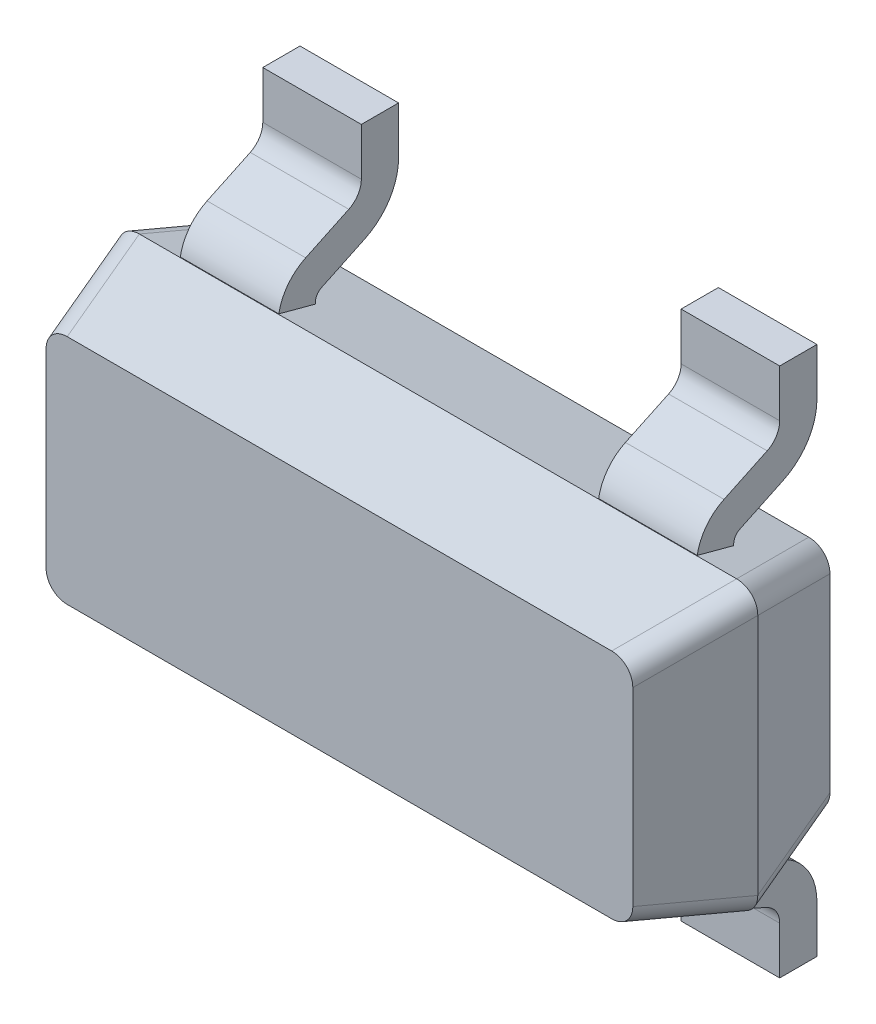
ISO-10303-21;
HEADER;
FILE_DESCRIPTION(('STEP AP214'),'2;1');
FILE_NAME('part.step','',(''),(''),'','','');
FILE_SCHEMA(('AUTOMOTIVE_DESIGN { 1 0 10303 214 1 1 1 1 }'));
ENDSEC;
DATA;
#1=APPLICATION_CONTEXT('core data for automotive mechanical design processes');
#2=APPLICATION_PROTOCOL_DEFINITION('international standard','automotive_design',2000,#1);
#3=PRODUCT_CONTEXT('',#1,'mechanical');
#4=PRODUCT('Part','Part','',(#3));
#5=PRODUCT_RELATED_PRODUCT_CATEGORY('part','',(#4));
#6=PRODUCT_DEFINITION_FORMATION('','',#4);
#7=PRODUCT_DEFINITION_CONTEXT('part definition',#1,'design');
#8=PRODUCT_DEFINITION('design','',#6,#7);
#9=PRODUCT_DEFINITION_SHAPE('','',#8);
#10=(LENGTH_UNIT() NAMED_UNIT(*) SI_UNIT(.MILLI.,.METRE.));
#11=(NAMED_UNIT(*) PLANE_ANGLE_UNIT() SI_UNIT($,.RADIAN.));
#12=(NAMED_UNIT(*) SI_UNIT($,.STERADIAN.) SOLID_ANGLE_UNIT());
#13=UNCERTAINTY_MEASURE_WITH_UNIT(LENGTH_MEASURE(1.E-05),#10,'distance_accuracy_value','');
#14=(GEOMETRIC_REPRESENTATION_CONTEXT(3) GLOBAL_UNCERTAINTY_ASSIGNED_CONTEXT((#13)) GLOBAL_UNIT_ASSIGNED_CONTEXT((#10,
#11,#12)) REPRESENTATION_CONTEXT('',''));
#15=CARTESIAN_POINT('',(0.,0.,0.));
#16=DIRECTION('',(0.,0.,1.));
#17=DIRECTION('',(1.,0.,0.));
#18=AXIS2_PLACEMENT_3D('',#15,#16,#17);
#19=CARTESIAN_POINT('',(-1.18,0.610777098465,0.33));
#20=DIRECTION('',(1.,0.,0.));
#21=DIRECTION('',(0.,-0.534749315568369,-0.845010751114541));
#22=AXIS2_PLACEMENT_3D('',#19,#20,#21);
#23=CYLINDRICAL_SURFACE('',#22,0.05);
#24=CARTESIAN_POINT('',(-0.73,0.610777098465,0.33));
#25=DIRECTION('',(-1.,0.,0.));
#26=DIRECTION('',(0.,0.,-1.));
#27=AXIS2_PLACEMENT_3D('',#24,#25,#26);
#28=CIRCLE('',#27,0.05);
#29=CARTESIAN_POINT('',(-0.73,0.610777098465,0.38));
#30=VERTEX_POINT('',#29);
#31=CARTESIAN_POINT('',(-0.73,0.65596399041,0.351404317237));
#32=VERTEX_POINT('',#31);
#33=EDGE_CURVE('E1012',#30,#32,#28,.T.);
#34=ORIENTED_EDGE('',*,*,#33,.F.);
#35=DIRECTION('',(1.,0.,0.));
#36=VECTOR('',#35,1.);
#37=CARTESIAN_POINT('',(-1.18,0.610777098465,0.38));
#38=LINE('',#37,#36);
#39=CARTESIAN_POINT('',(-1.18,0.610777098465,0.38));
#40=VERTEX_POINT('',#39);
#41=EDGE_CURVE('E866',#40,#30,#38,.T.);
#42=ORIENTED_EDGE('',*,*,#41,.F.);
#43=CARTESIAN_POINT('',(-1.18,0.610777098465,0.33));
#44=DIRECTION('',(-1.,0.,0.));
#45=DIRECTION('',(0.,0.,-1.));
#46=AXIS2_PLACEMENT_3D('',#43,#44,#45);
#47=CIRCLE('',#46,0.05);
#48=CARTESIAN_POINT('',(-1.18,0.65596399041,0.351404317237));
#49=VERTEX_POINT('',#48);
#50=EDGE_CURVE('E1120',#40,#49,#47,.T.);
#51=ORIENTED_EDGE('',*,*,#50,.T.);
#52=DIRECTION('',(-1.,0.,0.));
#53=VECTOR('',#52,1.);
#54=CARTESIAN_POINT('',(-1.18,0.65596399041,0.351404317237));
#55=LINE('',#54,#53);
#56=EDGE_CURVE('E11',#32,#49,#55,.T.);
#57=ORIENTED_EDGE('',*,*,#56,.F.);
#58=EDGE_LOOP('',(#34,#42,#51,#57));
#59=FACE_BOUND('',#58,.T.);
#60=ADVANCED_FACE('F17',(#59),#23,.F.);
#61=CARTESIAN_POINT('',(-1.18,0.74927392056,0.15441668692));
#62=DIRECTION('',(0.,-0.903737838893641,-0.42808634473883));
#63=DIRECTION('',(0.,0.42808634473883,-0.903737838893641));
#64=AXIS2_PLACEMENT_3D('',#61,#62,#63);
#65=PLANE('',#64);
#66=ORIENTED_EDGE('',*,*,#56,.T.);
#67=DIRECTION('',(0.,0.42808634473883,-0.903737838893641));
#68=VECTOR('',#67,1.);
#69=CARTESIAN_POINT('',(-1.18,0.65596399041,0.351404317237));
#70=LINE('',#69,#68);
#71=CARTESIAN_POINT('',(-1.18,0.74927392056,0.15441668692));
#72=VERTEX_POINT('',#71);
#73=EDGE_CURVE('E1116',#49,#72,#70,.T.);
#74=ORIENTED_EDGE('',*,*,#73,.T.);
#75=DIRECTION('',(-1.,0.,0.));
#76=VECTOR('',#75,1.);
#77=CARTESIAN_POINT('',(-1.18,0.74927392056,0.15441668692));
#78=LINE('',#77,#76);
#79=CARTESIAN_POINT('',(-0.73,0.74927392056,0.15441668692));
#80=VERTEX_POINT('',#79);
#81=EDGE_CURVE('E27',#80,#72,#78,.T.);
#82=ORIENTED_EDGE('',*,*,#81,.F.);
#83=DIRECTION('',(0.,0.42808634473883,-0.903737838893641));
#84=VECTOR('',#83,1.);
#85=CARTESIAN_POINT('',(-0.73,0.65596399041,0.351404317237));
#86=LINE('',#85,#84);
#87=EDGE_CURVE('E1135',#32,#80,#86,.T.);
#88=ORIENTED_EDGE('',*,*,#87,.F.);
#89=EDGE_LOOP('',(#66,#74,#82,#88));
#90=FACE_BOUND('',#89,.T.);
#91=ADVANCED_FACE('F1227',(#90),#65,.T.);
#92=CARTESIAN_POINT('',(-1.18,0.993283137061,0.27));
#93=DIRECTION('',(1.,0.,0.));
#94=DIRECTION('',(0.,0.534749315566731,0.845010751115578));
#95=AXIS2_PLACEMENT_3D('',#92,#93,#94);
#96=CYLINDRICAL_SURFACE('',#95,0.27);
#97=ORIENTED_EDGE('',*,*,#81,.T.);
#98=CARTESIAN_POINT('',(-1.18,0.993283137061,0.27));
#99=DIRECTION('',(1.,0.,0.));
#100=DIRECTION('',(0.,0.,-1.));
#101=AXIS2_PLACEMENT_3D('',#98,#99,#100);
#102=CIRCLE('',#101,0.27);
#103=CARTESIAN_POINT('',(-1.18,0.993283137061,0.));
#104=VERTEX_POINT('',#103);
#105=EDGE_CURVE('E971',#72,#104,#102,.T.);
#106=ORIENTED_EDGE('',*,*,#105,.T.);
#107=DIRECTION('',(-1.,0.,0.));
#108=VECTOR('',#107,1.);
#109=CARTESIAN_POINT('',(-1.18,0.993283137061,0.));
#110=LINE('',#109,#108);
#111=CARTESIAN_POINT('',(-0.73,0.993283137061,0.));
#112=VERTEX_POINT('',#111);
#113=EDGE_CURVE('E1173',#112,#104,#110,.T.);
#114=ORIENTED_EDGE('',*,*,#113,.F.);
#115=CARTESIAN_POINT('',(-0.73,0.993283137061,0.27));
#116=DIRECTION('',(1.,0.,0.));
#117=DIRECTION('',(0.,0.,-1.));
#118=AXIS2_PLACEMENT_3D('',#115,#116,#117);
#119=CIRCLE('',#118,0.27);
#120=EDGE_CURVE('E1139',#80,#112,#119,.T.);
#121=ORIENTED_EDGE('',*,*,#120,.F.);
#122=EDGE_LOOP('',(#97,#106,#114,#121));
#123=FACE_BOUND('',#122,.T.);
#124=ADVANCED_FACE('F1232',(#123),#96,.T.);
#125=CARTESIAN_POINT('',(-1.18,1.21,0.));
#126=DIRECTION('',(0.,0.,-1.));
#127=DIRECTION('',(-1.,0.,0.));
#128=AXIS2_PLACEMENT_3D('',#125,#126,#127);
#129=PLANE('',#128);
#130=ORIENTED_EDGE('',*,*,#113,.T.);
#131=DIRECTION('',(0.,1.,0.));
#132=VECTOR('',#131,1.);
#133=CARTESIAN_POINT('',(-1.18,0.993283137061,0.));
#134=LINE('',#133,#132);
#135=CARTESIAN_POINT('',(-1.18,1.21,0.));
#136=VERTEX_POINT('',#135);
#137=EDGE_CURVE('E966',#104,#136,#134,.T.);
#138=ORIENTED_EDGE('',*,*,#137,.T.);
#139=DIRECTION('',(-1.,0.,0.));
#140=VECTOR('',#139,1.);
#141=CARTESIAN_POINT('',(-1.18,1.21,0.));
#142=LINE('',#141,#140);
#143=CARTESIAN_POINT('',(-0.73,1.21,0.));
#144=VERTEX_POINT('',#143);
#145=EDGE_CURVE('E1169',#144,#136,#142,.T.);
#146=ORIENTED_EDGE('',*,*,#145,.F.);
#147=DIRECTION('',(0.,1.,0.));
#148=VECTOR('',#147,1.);
#149=CARTESIAN_POINT('',(-0.73,0.993283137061,0.));
#150=LINE('',#149,#148);
#151=EDGE_CURVE('E1143',#112,#144,#150,.T.);
#152=ORIENTED_EDGE('',*,*,#151,.F.);
#153=EDGE_LOOP('',(#130,#138,#146,#152));
#154=FACE_BOUND('',#153,.T.);
#155=ADVANCED_FACE('F2122',(#154),#129,.T.);
#156=CARTESIAN_POINT('',(-1.18,1.21,0.17));
#157=DIRECTION('',(0.,1.,0.));
#158=DIRECTION('',(1.,0.,0.));
#159=AXIS2_PLACEMENT_3D('',#156,#157,#158);
#160=PLANE('',#159);
#161=ORIENTED_EDGE('',*,*,#145,.T.);
#162=DIRECTION('',(0.,0.,1.));
#163=VECTOR('',#162,1.);
#164=CARTESIAN_POINT('',(-1.18,1.21,0.27));
#165=LINE('',#164,#163);
#166=CARTESIAN_POINT('',(-1.18,1.21,0.17));
#167=VERTEX_POINT('',#166);
#168=EDGE_CURVE('E972',#136,#167,#165,.T.);
#169=ORIENTED_EDGE('',*,*,#168,.T.);
#170=DIRECTION('',(-1.,0.,0.));
#171=VECTOR('',#170,1.);
#172=CARTESIAN_POINT('',(-1.18,1.21,0.17));
#173=LINE('',#172,#171);
#174=CARTESIAN_POINT('',(-0.73,1.21,0.17));
#175=VERTEX_POINT('',#174);
#176=EDGE_CURVE('E42',#175,#167,#173,.T.);
#177=ORIENTED_EDGE('',*,*,#176,.F.);
#178=DIRECTION('',(0.,0.,1.));
#179=VECTOR('',#178,1.);
#180=CARTESIAN_POINT('',(-0.73,1.21,0.27));
#181=LINE('',#180,#179);
#182=EDGE_CURVE('E1147',#144,#175,#181,.T.);
#183=ORIENTED_EDGE('',*,*,#182,.F.);
#184=EDGE_LOOP('',(#161,#169,#177,#183));
#185=FACE_BOUND('',#184,.T.);
#186=ADVANCED_FACE('F2126',(#185),#160,.T.);
#187=CARTESIAN_POINT('',(-1.18,0.610777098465,0.33));
#188=DIRECTION('',(1.,0.,0.));
#189=DIRECTION('',(0.,-0.606580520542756,-0.795022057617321));
#190=AXIS2_PLACEMENT_3D('',#187,#188,#189);
#191=CYLINDRICAL_SURFACE('',#190,0.22);
#192=CARTESIAN_POINT('',(-0.73,0.610777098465,0.33));
#193=DIRECTION('',(1.,0.,0.));
#194=DIRECTION('',(0.,0.,-1.));
#195=AXIS2_PLACEMENT_3D('',#192,#193,#194);
#196=CIRCLE('',#195,0.22);
#197=CARTESIAN_POINT('',(-0.73,0.809599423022,0.424178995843));
#198=VERTEX_POINT('',#197);
#199=CARTESIAN_POINT('',(-0.73,0.649098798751,0.546636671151));
#200=VERTEX_POINT('',#199);
#201=EDGE_CURVE('E1008',#198,#200,#196,.T.);
#202=ORIENTED_EDGE('',*,*,#201,.F.);
#203=DIRECTION('',(-1.,0.,0.));
#204=VECTOR('',#203,1.);
#205=CARTESIAN_POINT('',(-1.18,0.809599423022,0.424178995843));
#206=LINE('',#205,#204);
#207=CARTESIAN_POINT('',(-1.18,0.809599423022,0.424178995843));
#208=VERTEX_POINT('',#207);
#209=EDGE_CURVE('E1165',#198,#208,#206,.T.);
#210=ORIENTED_EDGE('',*,*,#209,.T.);
#211=CARTESIAN_POINT('',(-1.18,0.610777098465,0.33));
#212=DIRECTION('',(1.,0.,0.));
#213=DIRECTION('',(0.,0.,-1.));
#214=AXIS2_PLACEMENT_3D('',#211,#212,#213);
#215=CIRCLE('',#214,0.22);
#216=CARTESIAN_POINT('',(-1.18,0.649098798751,0.546636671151));
#217=VERTEX_POINT('',#216);
#218=EDGE_CURVE('E1097',#208,#217,#215,.T.);
#219=ORIENTED_EDGE('',*,*,#218,.T.);
#220=DIRECTION('',(-1.,0.,0.));
#221=VECTOR('',#220,1.);
#222=CARTESIAN_POINT('',(-1.46,0.649098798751,0.546636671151));
#223=LINE('',#222,#221);
#224=EDGE_CURVE('E453',#200,#217,#223,.T.);
#225=ORIENTED_EDGE('',*,*,#224,.F.);
#226=EDGE_LOOP('',(#202,#210,#219,#225));
#227=FACE_BOUND('',#226,.T.);
#228=ADVANCED_FACE('F2134',(#227),#191,.T.);
#229=CARTESIAN_POINT('',(-1.18,0.809599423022,0.424178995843));
#230=DIRECTION('',(0.,0.903737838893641,0.42808634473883));
#231=DIRECTION('',(1.,0.,0.));
#232=AXIS2_PLACEMENT_3D('',#229,#230,#231);
#233=PLANE('',#232);
#234=DIRECTION('',(-1.,0.,0.));
#235=VECTOR('',#234,1.);
#236=CARTESIAN_POINT('',(-1.18,0.902909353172,0.227191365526));
#237=LINE('',#236,#235);
#238=CARTESIAN_POINT('',(-0.73,0.902909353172,0.227191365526));
#239=VERTEX_POINT('',#238);
#240=CARTESIAN_POINT('',(-1.18,0.902909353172,0.227191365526));
#241=VERTEX_POINT('',#240);
#242=EDGE_CURVE('E1161',#239,#241,#237,.T.);
#243=ORIENTED_EDGE('',*,*,#242,.T.);
#244=DIRECTION('',(0.,-0.42808634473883,0.903737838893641));
#245=VECTOR('',#244,1.);
#246=CARTESIAN_POINT('',(-1.18,0.902909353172,0.227191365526));
#247=LINE('',#246,#245);
#248=EDGE_CURVE('E1101',#241,#208,#247,.T.);
#249=ORIENTED_EDGE('',*,*,#248,.T.);
#250=ORIENTED_EDGE('',*,*,#209,.F.);
#251=DIRECTION('',(0.,-0.42808634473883,0.903737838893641));
#252=VECTOR('',#251,1.);
#253=CARTESIAN_POINT('',(-0.73,0.902909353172,0.227191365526));
#254=LINE('',#253,#252);
#255=EDGE_CURVE('E1013',#239,#198,#254,.T.);
#256=ORIENTED_EDGE('',*,*,#255,.F.);
#257=EDGE_LOOP('',(#243,#249,#250,#256));
#258=FACE_BOUND('',#257,.T.);
#259=ADVANCED_FACE('F2144',(#258),#233,.T.);
#260=CARTESIAN_POINT('',(-1.18,0.993283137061,0.27));
#261=DIRECTION('',(1.,0.,0.));
#262=DIRECTION('',(0.,0.534749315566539,0.8450107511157));
#263=AXIS2_PLACEMENT_3D('',#260,#261,#262);
#264=CYLINDRICAL_SURFACE('',#263,0.1);
#265=CARTESIAN_POINT('',(-0.73,0.993283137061,0.27));
#266=DIRECTION('',(-1.,0.,0.));
#267=DIRECTION('',(0.,0.,-1.));
#268=AXIS2_PLACEMENT_3D('',#265,#266,#267);
#269=CIRCLE('',#268,0.1);
#270=CARTESIAN_POINT('',(-0.73,0.993283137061,0.17));
#271=VERTEX_POINT('',#270);
#272=EDGE_CURVE('E865',#271,#239,#269,.T.);
#273=ORIENTED_EDGE('',*,*,#272,.F.);
#274=DIRECTION('',(1.,0.,0.));
#275=VECTOR('',#274,1.);
#276=CARTESIAN_POINT('',(-1.18,0.993283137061,0.17));
#277=LINE('',#276,#275);
#278=CARTESIAN_POINT('',(-1.18,0.993283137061,0.17));
#279=VERTEX_POINT('',#278);
#280=EDGE_CURVE('E1157',#279,#271,#277,.T.);
#281=ORIENTED_EDGE('',*,*,#280,.F.);
#282=CARTESIAN_POINT('',(-1.18,0.993283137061,0.27));
#283=DIRECTION('',(-1.,0.,0.));
#284=DIRECTION('',(0.,0.,-1.));
#285=AXIS2_PLACEMENT_3D('',#282,#283,#284);
#286=CIRCLE('',#285,0.1);
#287=EDGE_CURVE('E1105',#279,#241,#286,.T.);
#288=ORIENTED_EDGE('',*,*,#287,.T.);
#289=ORIENTED_EDGE('',*,*,#242,.F.);
#290=EDGE_LOOP('',(#273,#281,#288,#289));
#291=FACE_BOUND('',#290,.T.);
#292=ADVANCED_FACE('F2139',(#291),#264,.F.);
#293=CARTESIAN_POINT('',(-1.18,1.21,0.17));
#294=DIRECTION('',(0.,0.,1.));
#295=DIRECTION('',(1.,0.,0.));
#296=AXIS2_PLACEMENT_3D('',#293,#294,#295);
#297=PLANE('',#296);
#298=ORIENTED_EDGE('',*,*,#176,.T.);
#299=DIRECTION('',(0.,-1.,0.));
#300=VECTOR('',#299,1.);
#301=CARTESIAN_POINT('',(-1.18,0.993283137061,0.17));
#302=LINE('',#301,#300);
#303=EDGE_CURVE('E1109',#167,#279,#302,.T.);
#304=ORIENTED_EDGE('',*,*,#303,.T.);
#305=ORIENTED_EDGE('',*,*,#280,.T.);
#306=DIRECTION('',(0.,-1.,0.));
#307=VECTOR('',#306,1.);
#308=CARTESIAN_POINT('',(-0.73,0.993283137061,0.17));
#309=LINE('',#308,#307);
#310=EDGE_CURVE('E1151',#175,#271,#309,.T.);
#311=ORIENTED_EDGE('',*,*,#310,.F.);
#312=EDGE_LOOP('',(#298,#304,#305,#311));
#313=FACE_BOUND('',#312,.T.);
#314=ADVANCED_FACE('F2143',(#313),#297,.T.);
#315=CARTESIAN_POINT('',(-0.73,0.993283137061,0.27));
#316=DIRECTION('',(1.,0.,0.));
#317=DIRECTION('',(0.,1.,0.));
#318=AXIS2_PLACEMENT_3D('',#315,#316,#317);
#319=PLANE('',#318);
#320=ORIENTED_EDGE('',*,*,#272,.T.);
#321=ORIENTED_EDGE('',*,*,#255,.T.);
#322=ORIENTED_EDGE('',*,*,#201,.T.);
#323=DIRECTION('',(0.,0.258819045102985,0.965925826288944));
#324=VECTOR('',#323,1.);
#325=CARTESIAN_POINT('',(-0.73,0.65,0.55));
#326=LINE('',#325,#324);
#327=CARTESIAN_POINT('',(-0.73,0.604448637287,0.38));
#328=VERTEX_POINT('',#327);
#329=EDGE_CURVE('E464',#328,#200,#326,.T.);
#330=ORIENTED_EDGE('',*,*,#329,.F.);
#331=DIRECTION('',(0.,1.,0.));
#332=VECTOR('',#331,1.);
#333=CARTESIAN_POINT('',(-0.73,0.993283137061,0.38));
#334=LINE('',#333,#332);
#335=EDGE_CURVE('E861',#328,#30,#334,.T.);
#336=ORIENTED_EDGE('',*,*,#335,.T.);
#337=ORIENTED_EDGE('',*,*,#33,.T.);
#338=ORIENTED_EDGE('',*,*,#87,.T.);
#339=ORIENTED_EDGE('',*,*,#120,.T.);
#340=ORIENTED_EDGE('',*,*,#151,.T.);
#341=ORIENTED_EDGE('',*,*,#182,.T.);
#342=ORIENTED_EDGE('',*,*,#310,.T.);
#343=EDGE_LOOP('',(#320,#321,#322,#330,#336,#337,#338,#339,#340,#341,#342));
#344=FACE_BOUND('',#343,.T.);
#345=ADVANCED_FACE('F1248',(#344),#319,.T.);
#346=CARTESIAN_POINT('',(-1.18,0.6,0.38));
#347=DIRECTION('',(0.,0.,-1.));
#348=DIRECTION('',(0.,-1.,0.));
#349=AXIS2_PLACEMENT_3D('',#346,#347,#348);
#350=PLANE('',#349);
#351=DIRECTION('',(0.,1.,0.));
#352=VECTOR('',#351,1.);
#353=CARTESIAN_POINT('',(-1.18,0.6,0.38));
#354=LINE('',#353,#352);
#355=CARTESIAN_POINT('',(-1.18,0.604448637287,0.38));
#356=VERTEX_POINT('',#355);
#357=EDGE_CURVE('E1055',#356,#40,#354,.T.);
#358=ORIENTED_EDGE('',*,*,#357,.T.);
#359=ORIENTED_EDGE('',*,*,#41,.T.);
#360=ORIENTED_EDGE('',*,*,#335,.F.);
#361=DIRECTION('',(1.,0.,0.));
#362=VECTOR('',#361,1.);
#363=CARTESIAN_POINT('',(-1.46,0.604448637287,0.38));
#364=LINE('',#363,#362);
#365=EDGE_CURVE('E459',#356,#328,#364,.T.);
#366=ORIENTED_EDGE('',*,*,#365,.F.);
#367=EDGE_LOOP('',(#358,#359,#360,#366));
#368=FACE_BOUND('',#367,.T.);
#369=ADVANCED_FACE('F1252',(#368),#350,.T.);
#370=CARTESIAN_POINT('',(-1.18,0.993283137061,0.27));
#371=DIRECTION('',(1.,0.,0.));
#372=DIRECTION('',(0.,1.,0.));
#373=AXIS2_PLACEMENT_3D('',#370,#371,#372);
#374=PLANE('',#373);
#375=ORIENTED_EDGE('',*,*,#218,.F.);
#376=ORIENTED_EDGE('',*,*,#248,.F.);
#377=ORIENTED_EDGE('',*,*,#287,.F.);
#378=ORIENTED_EDGE('',*,*,#303,.F.);
#379=ORIENTED_EDGE('',*,*,#168,.F.);
#380=ORIENTED_EDGE('',*,*,#137,.F.);
#381=ORIENTED_EDGE('',*,*,#105,.F.);
#382=ORIENTED_EDGE('',*,*,#73,.F.);
#383=ORIENTED_EDGE('',*,*,#50,.F.);
#384=ORIENTED_EDGE('',*,*,#357,.F.);
#385=DIRECTION('',(0.,-0.258819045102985,-0.965925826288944));
#386=VECTOR('',#385,1.);
#387=CARTESIAN_POINT('',(-1.18,0.65,0.55));
#388=LINE('',#387,#386);
#389=EDGE_CURVE('E444',#217,#356,#388,.T.);
#390=ORIENTED_EDGE('',*,*,#389,.F.);
#391=EDGE_LOOP('',(#375,#376,#377,#378,#379,#380,#381,#382,#383,#384,#390));
#392=FACE_BOUND('',#391,.T.);
#393=ADVANCED_FACE('F1262',(#392),#374,.F.);
#394=CARTESIAN_POINT('',(-1.18,-1.21,0.));
#395=DIRECTION('',(0.,0.,-1.));
#396=DIRECTION('',(0.,-1.,0.));
#397=AXIS2_PLACEMENT_3D('',#394,#395,#396);
#398=PLANE('',#397);
#399=DIRECTION('',(-1.,0.,0.));
#400=VECTOR('',#399,1.);
#401=CARTESIAN_POINT('',(-1.18,-1.21,0.));
#402=LINE('',#401,#400);
#403=CARTESIAN_POINT('',(-0.34,-1.21,0.));
#404=VERTEX_POINT('',#403);
#405=CARTESIAN_POINT('',(-1.18,-1.21,0.));
#406=VERTEX_POINT('',#405);
#407=EDGE_CURVE('E1093',#404,#406,#402,.T.);
#408=ORIENTED_EDGE('',*,*,#407,.T.);
#409=DIRECTION('',(0.,1.,0.));
#410=VECTOR('',#409,1.);
#411=CARTESIAN_POINT('',(-1.18,-0.993283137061,0.));
#412=LINE('',#411,#410);
#413=CARTESIAN_POINT('',(-1.18,-0.993283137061,0.));
#414=VERTEX_POINT('',#413);
#415=EDGE_CURVE('E1059',#406,#414,#412,.T.);
#416=ORIENTED_EDGE('',*,*,#415,.T.);
#417=DIRECTION('',(-1.,0.,0.));
#418=VECTOR('',#417,1.);
#419=CARTESIAN_POINT('',(-1.18,-0.993283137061,0.));
#420=LINE('',#419,#418);
#421=CARTESIAN_POINT('',(-0.34,-0.993283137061,0.));
#422=VERTEX_POINT('',#421);
#423=EDGE_CURVE('E637',#422,#414,#420,.T.);
#424=ORIENTED_EDGE('',*,*,#423,.F.);
#425=DIRECTION('',(0.,1.,0.));
#426=VECTOR('',#425,1.);
#427=CARTESIAN_POINT('',(-0.34,-0.610777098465,0.));
#428=LINE('',#427,#426);
#429=EDGE_CURVE('E815',#404,#422,#428,.T.);
#430=ORIENTED_EDGE('',*,*,#429,.F.);
#431=EDGE_LOOP('',(#408,#416,#424,#430));
#432=FACE_BOUND('',#431,.T.);
#433=ADVANCED_FACE('F1696',(#432),#398,.T.);
#434=CARTESIAN_POINT('',(-1.18,-1.21,0.17));
#435=DIRECTION('',(0.,-1.,0.));
#436=DIRECTION('',(0.,0.,-1.));
#437=AXIS2_PLACEMENT_3D('',#434,#435,#436);
#438=PLANE('',#437);
#439=DIRECTION('',(-1.,0.,0.));
#440=VECTOR('',#439,1.);
#441=CARTESIAN_POINT('',(-1.18,-1.21,0.17));
#442=LINE('',#441,#440);
#443=CARTESIAN_POINT('',(-0.34,-1.21,0.17));
#444=VERTEX_POINT('',#443);
#445=CARTESIAN_POINT('',(-1.18,-1.21,0.17));
#446=VERTEX_POINT('',#445);
#447=EDGE_CURVE('E1092',#444,#446,#442,.T.);
#448=ORIENTED_EDGE('',*,*,#447,.T.);
#449=DIRECTION('',(0.,0.,-1.));
#450=VECTOR('',#449,1.);
#451=CARTESIAN_POINT('',(-1.18,-1.21,0.27));
#452=LINE('',#451,#450);
#453=EDGE_CURVE('E1063',#446,#406,#452,.T.);
#454=ORIENTED_EDGE('',*,*,#453,.T.);
#455=ORIENTED_EDGE('',*,*,#407,.F.);
#456=DIRECTION('',(0.,0.,-1.));
#457=VECTOR('',#456,1.);
#458=CARTESIAN_POINT('',(-0.34,-1.21,0.33));
#459=LINE('',#458,#457);
#460=EDGE_CURVE('E1037',#444,#404,#459,.T.);
#461=ORIENTED_EDGE('',*,*,#460,.F.);
#462=EDGE_LOOP('',(#448,#454,#455,#461));
#463=FACE_BOUND('',#462,.T.);
#464=ADVANCED_FACE('F1701',(#463),#438,.T.);
#465=CARTESIAN_POINT('',(-1.18,-1.21,0.17));
#466=DIRECTION('',(0.,0.,1.));
#467=DIRECTION('',(1.,0.,0.));
#468=AXIS2_PLACEMENT_3D('',#465,#466,#467);
#469=PLANE('',#468);
#470=DIRECTION('',(-1.,0.,0.));
#471=VECTOR('',#470,1.);
#472=CARTESIAN_POINT('',(-1.18,-0.993283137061,0.17));
#473=LINE('',#472,#471);
#474=CARTESIAN_POINT('',(-0.34,-0.993283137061,0.17));
#475=VERTEX_POINT('',#474);
#476=CARTESIAN_POINT('',(-1.18,-0.993283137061,0.17));
#477=VERTEX_POINT('',#476);
#478=EDGE_CURVE('E1088',#475,#477,#473,.T.);
#479=ORIENTED_EDGE('',*,*,#478,.T.);
#480=DIRECTION('',(0.,-1.,0.));
#481=VECTOR('',#480,1.);
#482=CARTESIAN_POINT('',(-1.18,-0.993283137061,0.17));
#483=LINE('',#482,#481);
#484=EDGE_CURVE('E1067',#477,#446,#483,.T.);
#485=ORIENTED_EDGE('',*,*,#484,.T.);
#486=ORIENTED_EDGE('',*,*,#447,.F.);
#487=DIRECTION('',(0.,-1.,0.));
#488=VECTOR('',#487,1.);
#489=CARTESIAN_POINT('',(-0.34,-0.610777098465,0.17));
#490=LINE('',#489,#488);
#491=EDGE_CURVE('E1033',#475,#444,#490,.T.);
#492=ORIENTED_EDGE('',*,*,#491,.F.);
#493=EDGE_LOOP('',(#479,#485,#486,#492));
#494=FACE_BOUND('',#493,.T.);
#495=ADVANCED_FACE('F1706',(#494),#469,.T.);
#496=CARTESIAN_POINT('',(-1.18,-0.993283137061,0.27));
#497=DIRECTION('',(1.,0.,0.));
#498=DIRECTION('',(0.,-0.534749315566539,0.8450107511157));
#499=AXIS2_PLACEMENT_3D('',#496,#497,#498);
#500=CYLINDRICAL_SURFACE('',#499,0.1);
#501=CARTESIAN_POINT('',(-0.34,-0.993283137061,0.27));
#502=DIRECTION('',(-1.,0.,0.));
#503=DIRECTION('',(0.,0.,-1.));
#504=AXIS2_PLACEMENT_3D('',#501,#502,#503);
#505=CIRCLE('',#504,0.1);
#506=CARTESIAN_POINT('',(-0.34,-0.902909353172,0.227191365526));
#507=VERTEX_POINT('',#506);
#508=EDGE_CURVE('E1022',#507,#475,#505,.T.);
#509=ORIENTED_EDGE('',*,*,#508,.F.);
#510=DIRECTION('',(1.,0.,0.));
#511=VECTOR('',#510,1.);
#512=CARTESIAN_POINT('',(-1.18,-0.902909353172,0.227191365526));
#513=LINE('',#512,#511);
#514=CARTESIAN_POINT('',(-1.18,-0.902909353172,0.227191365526));
#515=VERTEX_POINT('',#514);
#516=EDGE_CURVE('E1084',#515,#507,#513,.T.);
#517=ORIENTED_EDGE('',*,*,#516,.F.);
#518=CARTESIAN_POINT('',(-1.18,-0.993283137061,0.27));
#519=DIRECTION('',(-1.,0.,0.));
#520=DIRECTION('',(0.,0.,-1.));
#521=AXIS2_PLACEMENT_3D('',#518,#519,#520);
#522=CIRCLE('',#521,0.1);
#523=EDGE_CURVE('E1071',#515,#477,#522,.T.);
#524=ORIENTED_EDGE('',*,*,#523,.T.);
#525=ORIENTED_EDGE('',*,*,#478,.F.);
#526=EDGE_LOOP('',(#509,#517,#524,#525));
#527=FACE_BOUND('',#526,.T.);
#528=ADVANCED_FACE('F1712',(#527),#500,.F.);
#529=CARTESIAN_POINT('',(-1.18,-0.809599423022,0.424178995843));
#530=DIRECTION('',(0.,-0.903737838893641,0.42808634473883));
#531=DIRECTION('',(-1.,0.,0.));
#532=AXIS2_PLACEMENT_3D('',#529,#530,#531);
#533=PLANE('',#532);
#534=DIRECTION('',(1.,0.,0.));
#535=VECTOR('',#534,1.);
#536=CARTESIAN_POINT('',(-1.18,-0.809599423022,0.424178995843));
#537=LINE('',#536,#535);
#538=CARTESIAN_POINT('',(-1.18,-0.809599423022,0.424178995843));
#539=VERTEX_POINT('',#538);
#540=CARTESIAN_POINT('',(-0.34,-0.809599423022,0.424178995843));
#541=VERTEX_POINT('',#540);
#542=EDGE_CURVE('E1083',#539,#541,#537,.T.);
#543=ORIENTED_EDGE('',*,*,#542,.F.);
#544=DIRECTION('',(0.,-0.42808634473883,-0.903737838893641));
#545=VECTOR('',#544,1.);
#546=CARTESIAN_POINT('',(-1.18,-0.809599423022,0.424178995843));
#547=LINE('',#546,#545);
#548=EDGE_CURVE('E1075',#539,#515,#547,.T.);
#549=ORIENTED_EDGE('',*,*,#548,.T.);
#550=ORIENTED_EDGE('',*,*,#516,.T.);
#551=DIRECTION('',(0.,-0.42808634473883,-0.903737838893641));
#552=VECTOR('',#551,1.);
#553=CARTESIAN_POINT('',(-0.34,-0.809599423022,0.424178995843));
#554=LINE('',#553,#552);
#555=EDGE_CURVE('E1018',#541,#507,#554,.T.);
#556=ORIENTED_EDGE('',*,*,#555,.F.);
#557=EDGE_LOOP('',(#543,#549,#550,#556));
#558=FACE_BOUND('',#557,.T.);
#559=ADVANCED_FACE('F1715',(#558),#533,.T.);
#560=CARTESIAN_POINT('',(-1.18,-0.610777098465,0.33));
#561=DIRECTION('',(1.,0.,0.));
#562=DIRECTION('',(0.,0.606580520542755,-0.795022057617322));
#563=AXIS2_PLACEMENT_3D('',#560,#561,#562);
#564=CYLINDRICAL_SURFACE('',#563,0.22);
#565=DIRECTION('',(1.,0.,0.));
#566=VECTOR('',#565,1.);
#567=CARTESIAN_POINT('',(-1.46,-0.649098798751,0.546636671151));
#568=LINE('',#567,#566);
#569=CARTESIAN_POINT('',(-1.18,-0.649098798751,0.546636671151));
#570=VERTEX_POINT('',#569);
#571=CARTESIAN_POINT('',(-0.34,-0.649098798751,0.546636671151));
#572=VERTEX_POINT('',#571);
#573=EDGE_CURVE('E753',#570,#572,#568,.T.);
#574=ORIENTED_EDGE('',*,*,#573,.F.);
#575=CARTESIAN_POINT('',(-1.18,-0.610777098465,0.33));
#576=DIRECTION('',(1.,0.,0.));
#577=DIRECTION('',(0.,0.,-1.));
#578=AXIS2_PLACEMENT_3D('',#575,#576,#577);
#579=CIRCLE('',#578,0.22);
#580=EDGE_CURVE('E1079',#570,#539,#579,.T.);
#581=ORIENTED_EDGE('',*,*,#580,.T.);
#582=ORIENTED_EDGE('',*,*,#542,.T.);
#583=CARTESIAN_POINT('',(-0.34,-0.610777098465,0.33));
#584=DIRECTION('',(1.,0.,0.));
#585=DIRECTION('',(0.,0.,-1.));
#586=AXIS2_PLACEMENT_3D('',#583,#584,#585);
#587=CIRCLE('',#586,0.22);
#588=EDGE_CURVE('E1023',#572,#541,#587,.T.);
#589=ORIENTED_EDGE('',*,*,#588,.F.);
#590=EDGE_LOOP('',(#574,#581,#582,#589));
#591=FACE_BOUND('',#590,.T.);
#592=ADVANCED_FACE('F1720',(#591),#564,.T.);
#593=CARTESIAN_POINT('',(-1.18,-0.993283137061,0.27));
#594=DIRECTION('',(1.,0.,0.));
#595=DIRECTION('',(0.,1.,0.));
#596=AXIS2_PLACEMENT_3D('',#593,#594,#595);
#597=PLANE('',#596);
#598=DIRECTION('',(0.,1.,0.));
#599=VECTOR('',#598,1.);
#600=CARTESIAN_POINT('',(-1.18,-0.993283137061,0.38));
#601=LINE('',#600,#599);
#602=CARTESIAN_POINT('',(-1.18,-0.610777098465,0.38));
#603=VERTEX_POINT('',#602);
#604=CARTESIAN_POINT('',(-1.18,-0.604448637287,0.38));
#605=VERTEX_POINT('',#604);
#606=EDGE_CURVE('E1052',#603,#605,#601,.T.);
#607=ORIENTED_EDGE('',*,*,#606,.F.);
#608=CARTESIAN_POINT('',(-1.18,-0.610777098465,0.33));
#609=DIRECTION('',(-1.,0.,0.));
#610=DIRECTION('',(0.,0.,-1.));
#611=AXIS2_PLACEMENT_3D('',#608,#609,#610);
#612=CIRCLE('',#611,0.05);
#613=CARTESIAN_POINT('',(-1.18,-0.65596399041,0.351404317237));
#614=VERTEX_POINT('',#613);
#615=EDGE_CURVE('E1044',#614,#603,#612,.T.);
#616=ORIENTED_EDGE('',*,*,#615,.F.);
#617=DIRECTION('',(0.,0.42808634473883,0.903737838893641));
#618=VECTOR('',#617,1.);
#619=CARTESIAN_POINT('',(-1.18,-0.74927392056,0.15441668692));
#620=LINE('',#619,#618);
#621=CARTESIAN_POINT('',(-1.18,-0.74927392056,0.15441668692));
#622=VERTEX_POINT('',#621);
#623=EDGE_CURVE('E618',#622,#614,#620,.T.);
#624=ORIENTED_EDGE('',*,*,#623,.F.);
#625=CARTESIAN_POINT('',(-1.18,-0.993283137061,0.27));
#626=DIRECTION('',(1.,0.,0.));
#627=DIRECTION('',(0.,0.,-1.));
#628=AXIS2_PLACEMENT_3D('',#625,#626,#627);
#629=CIRCLE('',#628,0.27);
#630=EDGE_CURVE('E642',#414,#622,#629,.T.);
#631=ORIENTED_EDGE('',*,*,#630,.F.);
#632=ORIENTED_EDGE('',*,*,#415,.F.);
#633=ORIENTED_EDGE('',*,*,#453,.F.);
#634=ORIENTED_EDGE('',*,*,#484,.F.);
#635=ORIENTED_EDGE('',*,*,#523,.F.);
#636=ORIENTED_EDGE('',*,*,#548,.F.);
#637=ORIENTED_EDGE('',*,*,#580,.F.);
#638=DIRECTION('',(0.,-0.258819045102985,0.965925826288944));
#639=VECTOR('',#638,1.);
#640=CARTESIAN_POINT('',(-1.18,-0.65,0.55));
#641=LINE('',#640,#639);
#642=EDGE_CURVE('E747',#605,#570,#641,.T.);
#643=ORIENTED_EDGE('',*,*,#642,.F.);
#644=EDGE_LOOP('',(#607,#616,#624,#631,#632,#633,#634,#635,#636,#637,#643));
#645=FACE_BOUND('',#644,.T.);
#646=ADVANCED_FACE('F1683',(#645),#597,.F.);
#647=CARTESIAN_POINT('',(-1.18,-0.6,0.38));
#648=DIRECTION('',(0.,0.,-1.));
#649=DIRECTION('',(0.,-1.,0.));
#650=AXIS2_PLACEMENT_3D('',#647,#648,#649);
#651=PLANE('',#650);
#652=DIRECTION('',(0.,-1.,0.));
#653=VECTOR('',#652,1.);
#654=CARTESIAN_POINT('',(-0.34,-0.6,0.38));
#655=LINE('',#654,#653);
#656=CARTESIAN_POINT('',(-0.34,-0.604448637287,0.38));
#657=VERTEX_POINT('',#656);
#658=CARTESIAN_POINT('',(-0.34,-0.610777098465,0.38));
#659=VERTEX_POINT('',#658);
#660=EDGE_CURVE('E659',#657,#659,#655,.T.);
#661=ORIENTED_EDGE('',*,*,#660,.T.);
#662=DIRECTION('',(-1.,0.,0.));
#663=VECTOR('',#662,1.);
#664=CARTESIAN_POINT('',(-1.18,-0.610777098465,0.38));
#665=LINE('',#664,#663);
#666=EDGE_CURVE('E1048',#659,#603,#665,.T.);
#667=ORIENTED_EDGE('',*,*,#666,.T.);
#668=ORIENTED_EDGE('',*,*,#606,.T.);
#669=DIRECTION('',(-1.,0.,0.));
#670=VECTOR('',#669,1.);
#671=CARTESIAN_POINT('',(-1.46,-0.604448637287,0.38));
#672=LINE('',#671,#670);
#673=EDGE_CURVE('E738',#657,#605,#672,.T.);
#674=ORIENTED_EDGE('',*,*,#673,.F.);
#675=EDGE_LOOP('',(#661,#667,#668,#674));
#676=FACE_BOUND('',#675,.T.);
#677=ADVANCED_FACE('F1725',(#676),#651,.T.);
#678=CARTESIAN_POINT('',(-1.18,-0.610777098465,0.33));
#679=DIRECTION('',(1.,0.,0.));
#680=DIRECTION('',(0.,0.534749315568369,-0.845010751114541));
#681=AXIS2_PLACEMENT_3D('',#678,#679,#680);
#682=CYLINDRICAL_SURFACE('',#681,0.05);
#683=CARTESIAN_POINT('',(-0.34,-0.610777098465,0.33));
#684=DIRECTION('',(-1.,0.,0.));
#685=DIRECTION('',(0.,0.,-1.));
#686=AXIS2_PLACEMENT_3D('',#683,#684,#685);
#687=CIRCLE('',#686,0.05);
#688=CARTESIAN_POINT('',(-0.34,-0.65596399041,0.351404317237));
#689=VERTEX_POINT('',#688);
#690=EDGE_CURVE('E655',#689,#659,#687,.T.);
#691=ORIENTED_EDGE('',*,*,#690,.F.);
#692=DIRECTION('',(1.,0.,0.));
#693=VECTOR('',#692,1.);
#694=CARTESIAN_POINT('',(-1.18,-0.65596399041,0.351404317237));
#695=LINE('',#694,#693);
#696=EDGE_CURVE('E623',#614,#689,#695,.T.);
#697=ORIENTED_EDGE('',*,*,#696,.F.);
#698=ORIENTED_EDGE('',*,*,#615,.T.);
#699=ORIENTED_EDGE('',*,*,#666,.F.);
#700=EDGE_LOOP('',(#691,#697,#698,#699));
#701=FACE_BOUND('',#700,.T.);
#702=ADVANCED_FACE('F1686',(#701),#682,.F.);
#703=CARTESIAN_POINT('',(-1.18,-0.74927392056,0.15441668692));
#704=DIRECTION('',(0.,0.903737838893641,-0.42808634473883));
#705=DIRECTION('',(-1.,0.,0.));
#706=AXIS2_PLACEMENT_3D('',#703,#704,#705);
#707=PLANE('',#706);
#708=DIRECTION('',(-1.,0.,0.));
#709=VECTOR('',#708,1.);
#710=CARTESIAN_POINT('',(-1.18,-0.74927392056,0.15441668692));
#711=LINE('',#710,#709);
#712=CARTESIAN_POINT('',(-0.34,-0.74927392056,0.15441668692));
#713=VERTEX_POINT('',#712);
#714=EDGE_CURVE('E624',#713,#622,#711,.T.);
#715=ORIENTED_EDGE('',*,*,#714,.T.);
#716=ORIENTED_EDGE('',*,*,#623,.T.);
#717=ORIENTED_EDGE('',*,*,#696,.T.);
#718=DIRECTION('',(0.,0.42808634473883,0.903737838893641));
#719=VECTOR('',#718,1.);
#720=CARTESIAN_POINT('',(-0.34,-0.74927392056,0.15441668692));
#721=LINE('',#720,#719);
#722=EDGE_CURVE('E660',#713,#689,#721,.T.);
#723=ORIENTED_EDGE('',*,*,#722,.F.);
#724=EDGE_LOOP('',(#715,#716,#717,#723));
#725=FACE_BOUND('',#724,.T.);
#726=ADVANCED_FACE('F1688',(#725),#707,.T.);
#727=CARTESIAN_POINT('',(-1.18,-0.993283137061,0.27));
#728=DIRECTION('',(1.,0.,0.));
#729=DIRECTION('',(0.,-0.534749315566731,0.845010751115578));
#730=AXIS2_PLACEMENT_3D('',#727,#728,#729);
#731=CYLINDRICAL_SURFACE('',#730,0.27);
#732=ORIENTED_EDGE('',*,*,#423,.T.);
#733=ORIENTED_EDGE('',*,*,#630,.T.);
#734=ORIENTED_EDGE('',*,*,#714,.F.);
#735=CARTESIAN_POINT('',(-0.34,-0.993283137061,0.27));
#736=DIRECTION('',(1.,0.,0.));
#737=DIRECTION('',(0.,0.,-1.));
#738=AXIS2_PLACEMENT_3D('',#735,#736,#737);
#739=CIRCLE('',#738,0.27);
#740=EDGE_CURVE('E643',#422,#713,#739,.T.);
#741=ORIENTED_EDGE('',*,*,#740,.F.);
#742=EDGE_LOOP('',(#732,#733,#734,#741));
#743=FACE_BOUND('',#742,.T.);
#744=ADVANCED_FACE('F1691',(#743),#731,.T.);
#745=CARTESIAN_POINT('',(-0.34,-0.610777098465,0.33));
#746=DIRECTION('',(1.,0.,0.));
#747=DIRECTION('',(0.,1.,0.));
#748=AXIS2_PLACEMENT_3D('',#745,#746,#747);
#749=PLANE('',#748);
#750=ORIENTED_EDGE('',*,*,#722,.T.);
#751=ORIENTED_EDGE('',*,*,#690,.T.);
#752=ORIENTED_EDGE('',*,*,#660,.F.);
#753=DIRECTION('',(0.,0.258819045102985,-0.965925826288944));
#754=VECTOR('',#753,1.);
#755=CARTESIAN_POINT('',(-0.34,-0.65,0.55));
#756=LINE('',#755,#754);
#757=EDGE_CURVE('E758',#572,#657,#756,.T.);
#758=ORIENTED_EDGE('',*,*,#757,.F.);
#759=ORIENTED_EDGE('',*,*,#588,.T.);
#760=ORIENTED_EDGE('',*,*,#555,.T.);
#761=ORIENTED_EDGE('',*,*,#508,.T.);
#762=ORIENTED_EDGE('',*,*,#491,.T.);
#763=ORIENTED_EDGE('',*,*,#460,.T.);
#764=ORIENTED_EDGE('',*,*,#429,.T.);
#765=ORIENTED_EDGE('',*,*,#740,.T.);
#766=EDGE_LOOP('',(#750,#751,#752,#758,#759,#760,#761,#762,#763,#764,#765));
#767=FACE_BOUND('',#766,.T.);
#768=ADVANCED_FACE('F1727',(#767),#749,.T.);
#769=CARTESIAN_POINT('',(0.73,-0.809599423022,0.424178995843));
#770=DIRECTION('',(0.,-0.903737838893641,0.42808634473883));
#771=DIRECTION('',(-1.,0.,0.));
#772=AXIS2_PLACEMENT_3D('',#769,#770,#771);
#773=PLANE('',#772);
#774=DIRECTION('',(1.,0.,0.));
#775=VECTOR('',#774,1.);
#776=CARTESIAN_POINT('',(0.73,-0.809599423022,0.424178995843));
#777=LINE('',#776,#775);
#778=CARTESIAN_POINT('',(0.73,-0.809599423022,0.424178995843));
#779=VERTEX_POINT('',#778);
#780=CARTESIAN_POINT('',(1.18,-0.809599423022,0.424178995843));
#781=VERTEX_POINT('',#780);
#782=EDGE_CURVE('E518',#779,#781,#777,.T.);
#783=ORIENTED_EDGE('',*,*,#782,.F.);
#784=DIRECTION('',(0.,-0.42808634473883,-0.903737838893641));
#785=VECTOR('',#784,1.);
#786=CARTESIAN_POINT('',(0.73,-0.809599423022,0.424178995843));
#787=LINE('',#786,#785);
#788=CARTESIAN_POINT('',(0.73,-0.902909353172,0.227191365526));
#789=VERTEX_POINT('',#788);
#790=EDGE_CURVE('E855',#779,#789,#787,.T.);
#791=ORIENTED_EDGE('',*,*,#790,.T.);
#792=DIRECTION('',(1.,0.,0.));
#793=VECTOR('',#792,1.);
#794=CARTESIAN_POINT('',(0.73,-0.902909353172,0.227191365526));
#795=LINE('',#794,#793);
#796=CARTESIAN_POINT('',(1.18,-0.902909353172,0.227191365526));
#797=VERTEX_POINT('',#796);
#798=EDGE_CURVE('E835',#789,#797,#795,.T.);
#799=ORIENTED_EDGE('',*,*,#798,.T.);
#800=DIRECTION('',(0.,-0.42808634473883,-0.903737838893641));
#801=VECTOR('',#800,1.);
#802=CARTESIAN_POINT('',(1.18,-0.809599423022,0.424178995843));
#803=LINE('',#802,#801);
#804=EDGE_CURVE('E681',#781,#797,#803,.T.);
#805=ORIENTED_EDGE('',*,*,#804,.F.);
#806=EDGE_LOOP('',(#783,#791,#799,#805));
#807=FACE_BOUND('',#806,.T.);
#808=ADVANCED_FACE('F2215',(#807),#773,.T.);
#809=CARTESIAN_POINT('',(0.73,-0.993283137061,0.27));
#810=DIRECTION('',(1.,0.,0.));
#811=DIRECTION('',(0.,-0.534749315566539,0.8450107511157));
#812=AXIS2_PLACEMENT_3D('',#809,#810,#811);
#813=CYLINDRICAL_SURFACE('',#812,0.1);
#814=CARTESIAN_POINT('',(1.18,-0.993283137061,0.27));
#815=DIRECTION('',(-1.,0.,0.));
#816=DIRECTION('',(0.,0.,-1.));
#817=AXIS2_PLACEMENT_3D('',#814,#815,#816);
#818=CIRCLE('',#817,0.1);
#819=CARTESIAN_POINT('',(1.18,-0.993283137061,0.17));
#820=VERTEX_POINT('',#819);
#821=EDGE_CURVE('E685',#797,#820,#818,.T.);
#822=ORIENTED_EDGE('',*,*,#821,.F.);
#823=ORIENTED_EDGE('',*,*,#798,.F.);
#824=CARTESIAN_POINT('',(0.73,-0.993283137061,0.27));
#825=DIRECTION('',(-1.,0.,0.));
#826=DIRECTION('',(0.,0.,-1.));
#827=AXIS2_PLACEMENT_3D('',#824,#825,#826);
#828=CIRCLE('',#827,0.1);
#829=CARTESIAN_POINT('',(0.73,-0.993283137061,0.17));
#830=VERTEX_POINT('',#829);
#831=EDGE_CURVE('E791',#789,#830,#828,.T.);
#832=ORIENTED_EDGE('',*,*,#831,.T.);
#833=DIRECTION('',(-1.,0.,0.));
#834=VECTOR('',#833,1.);
#835=CARTESIAN_POINT('',(0.73,-0.993283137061,0.17));
#836=LINE('',#835,#834);
#837=EDGE_CURVE('E830',#820,#830,#836,.T.);
#838=ORIENTED_EDGE('',*,*,#837,.F.);
#839=EDGE_LOOP('',(#822,#823,#832,#838));
#840=FACE_BOUND('',#839,.T.);
#841=ADVANCED_FACE('F2238',(#840),#813,.F.);
#842=CARTESIAN_POINT('',(0.73,-1.21,0.17));
#843=DIRECTION('',(0.,0.,1.));
#844=DIRECTION('',(1.,0.,0.));
#845=AXIS2_PLACEMENT_3D('',#842,#843,#844);
#846=PLANE('',#845);
#847=ORIENTED_EDGE('',*,*,#837,.T.);
#848=DIRECTION('',(0.,-1.,0.));
#849=VECTOR('',#848,1.);
#850=CARTESIAN_POINT('',(0.73,-0.993283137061,0.17));
#851=LINE('',#850,#849);
#852=CARTESIAN_POINT('',(0.73,-1.21,0.17));
#853=VERTEX_POINT('',#852);
#854=EDGE_CURVE('E786',#830,#853,#851,.T.);
#855=ORIENTED_EDGE('',*,*,#854,.T.);
#856=DIRECTION('',(-1.,0.,0.));
#857=VECTOR('',#856,1.);
#858=CARTESIAN_POINT('',(0.73,-1.21,0.17));
#859=LINE('',#858,#857);
#860=CARTESIAN_POINT('',(1.18,-1.21,0.17));
#861=VERTEX_POINT('',#860);
#862=EDGE_CURVE('E836',#861,#853,#859,.T.);
#863=ORIENTED_EDGE('',*,*,#862,.F.);
#864=DIRECTION('',(0.,-1.,0.));
#865=VECTOR('',#864,1.);
#866=CARTESIAN_POINT('',(1.18,-0.993283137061,0.17));
#867=LINE('',#866,#865);
#868=EDGE_CURVE('E1003',#820,#861,#867,.T.);
#869=ORIENTED_EDGE('',*,*,#868,.F.);
#870=EDGE_LOOP('',(#847,#855,#863,#869));
#871=FACE_BOUND('',#870,.T.);
#872=ADVANCED_FACE('F2247',(#871),#846,.T.);
#873=CARTESIAN_POINT('',(0.73,-1.21,0.17));
#874=DIRECTION('',(0.,-1.,0.));
#875=DIRECTION('',(0.,0.,-1.));
#876=AXIS2_PLACEMENT_3D('',#873,#874,#875);
#877=PLANE('',#876);
#878=ORIENTED_EDGE('',*,*,#862,.T.);
#879=DIRECTION('',(0.,0.,-1.));
#880=VECTOR('',#879,1.);
#881=CARTESIAN_POINT('',(0.73,-1.21,0.27));
#882=LINE('',#881,#880);
#883=CARTESIAN_POINT('',(0.73,-1.21,0.));
#884=VERTEX_POINT('',#883);
#885=EDGE_CURVE('E792',#853,#884,#882,.T.);
#886=ORIENTED_EDGE('',*,*,#885,.T.);
#887=DIRECTION('',(-1.,0.,0.));
#888=VECTOR('',#887,1.);
#889=CARTESIAN_POINT('',(0.73,-1.21,0.));
#890=LINE('',#889,#888);
#891=CARTESIAN_POINT('',(1.18,-1.21,0.));
#892=VERTEX_POINT('',#891);
#893=EDGE_CURVE('E536',#892,#884,#890,.T.);
#894=ORIENTED_EDGE('',*,*,#893,.F.);
#895=DIRECTION('',(0.,0.,-1.));
#896=VECTOR('',#895,1.);
#897=CARTESIAN_POINT('',(1.18,-1.21,0.27));
#898=LINE('',#897,#896);
#899=EDGE_CURVE('E493',#861,#892,#898,.T.);
#900=ORIENTED_EDGE('',*,*,#899,.F.);
#901=EDGE_LOOP('',(#878,#886,#894,#900));
#902=FACE_BOUND('',#901,.T.);
#903=ADVANCED_FACE('F2260',(#902),#877,.T.);
#904=CARTESIAN_POINT('',(0.73,-1.21,0.));
#905=DIRECTION('',(0.,0.,-1.));
#906=DIRECTION('',(0.,-1.,0.));
#907=AXIS2_PLACEMENT_3D('',#904,#905,#906);
#908=PLANE('',#907);
#909=ORIENTED_EDGE('',*,*,#893,.T.);
#910=DIRECTION('',(0.,1.,0.));
#911=VECTOR('',#910,1.);
#912=CARTESIAN_POINT('',(0.73,-0.993283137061,0.));
#913=LINE('',#912,#911);
#914=CARTESIAN_POINT('',(0.73,-0.993283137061,0.));
#915=VERTEX_POINT('',#914);
#916=EDGE_CURVE('E843',#884,#915,#913,.T.);
#917=ORIENTED_EDGE('',*,*,#916,.T.);
#918=DIRECTION('',(-1.,0.,0.));
#919=VECTOR('',#918,1.);
#920=CARTESIAN_POINT('',(0.73,-0.993283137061,0.));
#921=LINE('',#920,#919);
#922=CARTESIAN_POINT('',(1.18,-0.993283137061,0.));
#923=VERTEX_POINT('',#922);
#924=EDGE_CURVE('E769',#923,#915,#921,.T.);
#925=ORIENTED_EDGE('',*,*,#924,.F.);
#926=DIRECTION('',(0.,1.,0.));
#927=VECTOR('',#926,1.);
#928=CARTESIAN_POINT('',(1.18,-0.993283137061,0.));
#929=LINE('',#928,#927);
#930=EDGE_CURVE('E487',#892,#923,#929,.T.);
#931=ORIENTED_EDGE('',*,*,#930,.F.);
#932=EDGE_LOOP('',(#909,#917,#925,#931));
#933=FACE_BOUND('',#932,.T.);
#934=ADVANCED_FACE('F2264',(#933),#908,.T.);
#935=CARTESIAN_POINT('',(0.73,-0.6,0.38));
#936=DIRECTION('',(0.,0.,-1.));
#937=DIRECTION('',(0.,-1.,0.));
#938=AXIS2_PLACEMENT_3D('',#935,#936,#937);
#939=PLANE('',#938);
#940=DIRECTION('',(0.,1.,0.));
#941=VECTOR('',#940,1.);
#942=CARTESIAN_POINT('',(1.18,-0.993283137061,0.38));
#943=LINE('',#942,#941);
#944=CARTESIAN_POINT('',(1.18,-0.610777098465,0.38));
#945=VERTEX_POINT('',#944);
#946=CARTESIAN_POINT('',(1.18,-0.604448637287,0.38));
#947=VERTEX_POINT('',#946);
#948=EDGE_CURVE('E686',#945,#947,#943,.T.);
#949=ORIENTED_EDGE('',*,*,#948,.F.);
#950=DIRECTION('',(-1.,0.,0.));
#951=VECTOR('',#950,1.);
#952=CARTESIAN_POINT('',(0.73,-0.610777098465,0.38));
#953=LINE('',#952,#951);
#954=CARTESIAN_POINT('',(0.73,-0.610777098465,0.38));
#955=VERTEX_POINT('',#954);
#956=EDGE_CURVE('E531',#945,#955,#953,.T.);
#957=ORIENTED_EDGE('',*,*,#956,.T.);
#958=DIRECTION('',(0.,1.,0.));
#959=VECTOR('',#958,1.);
#960=CARTESIAN_POINT('',(0.73,-0.993283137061,0.38));
#961=LINE('',#960,#959);
#962=CARTESIAN_POINT('',(0.73,-0.604448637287,0.38));
#963=VERTEX_POINT('',#962);
#964=EDGE_CURVE('E805',#955,#963,#961,.T.);
#965=ORIENTED_EDGE('',*,*,#964,.T.);
#966=DIRECTION('',(-1.,0.,0.));
#967=VECTOR('',#966,1.);
#968=CARTESIAN_POINT('',(-1.46,-0.604448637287,0.38));
#969=LINE('',#968,#967);
#970=EDGE_CURVE('E925',#947,#963,#969,.T.);
#971=ORIENTED_EDGE('',*,*,#970,.F.);
#972=EDGE_LOOP('',(#949,#957,#965,#971));
#973=FACE_BOUND('',#972,.T.);
#974=ADVANCED_FACE('F2273',(#973),#939,.T.);
#975=CARTESIAN_POINT('',(0.73,-0.610777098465,0.33));
#976=DIRECTION('',(1.,0.,0.));
#977=DIRECTION('',(0.,0.534749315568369,-0.845010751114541));
#978=AXIS2_PLACEMENT_3D('',#975,#976,#977);
#979=CYLINDRICAL_SURFACE('',#978,0.05);
#980=CARTESIAN_POINT('',(1.18,-0.610777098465,0.33));
#981=DIRECTION('',(-1.,0.,0.));
#982=DIRECTION('',(0.,0.,-1.));
#983=AXIS2_PLACEMENT_3D('',#980,#981,#982);
#984=CIRCLE('',#983,0.05);
#985=CARTESIAN_POINT('',(1.18,-0.65596399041,0.351404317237));
#986=VERTEX_POINT('',#985);
#987=EDGE_CURVE('E699',#986,#945,#984,.T.);
#988=ORIENTED_EDGE('',*,*,#987,.F.);
#989=DIRECTION('',(1.,0.,0.));
#990=VECTOR('',#989,1.);
#991=CARTESIAN_POINT('',(0.73,-0.65596399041,0.351404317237));
#992=LINE('',#991,#990);
#993=CARTESIAN_POINT('',(0.73,-0.65596399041,0.351404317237));
#994=VERTEX_POINT('',#993);
#995=EDGE_CURVE('E537',#994,#986,#992,.T.);
#996=ORIENTED_EDGE('',*,*,#995,.F.);
#997=CARTESIAN_POINT('',(0.73,-0.610777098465,0.33));
#998=DIRECTION('',(-1.,0.,0.));
#999=DIRECTION('',(0.,0.,-1.));
#1000=AXIS2_PLACEMENT_3D('',#997,#998,#999);
#1001=CIRCLE('',#1000,0.05);
#1002=EDGE_CURVE('E799',#994,#955,#1001,.T.);
#1003=ORIENTED_EDGE('',*,*,#1002,.T.);
#1004=ORIENTED_EDGE('',*,*,#956,.F.);
#1005=EDGE_LOOP('',(#988,#996,#1003,#1004));
#1006=FACE_BOUND('',#1005,.T.);
#1007=ADVANCED_FACE('F2282',(#1006),#979,.F.);
#1008=CARTESIAN_POINT('',(0.73,-0.74927392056,0.15441668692));
#1009=DIRECTION('',(0.,0.903737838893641,-0.42808634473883));
#1010=DIRECTION('',(-1.,0.,0.));
#1011=AXIS2_PLACEMENT_3D('',#1008,#1009,#1010);
#1012=PLANE('',#1011);
#1013=DIRECTION('',(-1.,0.,0.));
#1014=VECTOR('',#1013,1.);
#1015=CARTESIAN_POINT('',(0.73,-0.74927392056,0.15441668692));
#1016=LINE('',#1015,#1014);
#1017=CARTESIAN_POINT('',(1.18,-0.74927392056,0.15441668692));
#1018=VERTEX_POINT('',#1017);
#1019=CARTESIAN_POINT('',(0.73,-0.74927392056,0.15441668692));
#1020=VERTEX_POINT('',#1019);
#1021=EDGE_CURVE('E764',#1018,#1020,#1016,.T.);
#1022=ORIENTED_EDGE('',*,*,#1021,.T.);
#1023=DIRECTION('',(0.,0.42808634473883,0.903737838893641));
#1024=VECTOR('',#1023,1.);
#1025=CARTESIAN_POINT('',(0.73,-0.74927392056,0.15441668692));
#1026=LINE('',#1025,#1024);
#1027=EDGE_CURVE('E804',#1020,#994,#1026,.T.);
#1028=ORIENTED_EDGE('',*,*,#1027,.T.);
#1029=ORIENTED_EDGE('',*,*,#995,.T.);
#1030=DIRECTION('',(0.,0.42808634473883,0.903737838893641));
#1031=VECTOR('',#1030,1.);
#1032=CARTESIAN_POINT('',(1.18,-0.74927392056,0.15441668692));
#1033=LINE('',#1032,#1031);
#1034=EDGE_CURVE('E709',#1018,#986,#1033,.T.);
#1035=ORIENTED_EDGE('',*,*,#1034,.F.);
#1036=EDGE_LOOP('',(#1022,#1028,#1029,#1035));
#1037=FACE_BOUND('',#1036,.T.);
#1038=ADVANCED_FACE('F2288',(#1037),#1012,.T.);
#1039=CARTESIAN_POINT('',(0.73,-0.993283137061,0.27));
#1040=DIRECTION('',(1.,0.,0.));
#1041=DIRECTION('',(0.,-0.534749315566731,0.845010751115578));
#1042=AXIS2_PLACEMENT_3D('',#1039,#1040,#1041);
#1043=CYLINDRICAL_SURFACE('',#1042,0.27);
#1044=ORIENTED_EDGE('',*,*,#924,.T.);
#1045=CARTESIAN_POINT('',(0.73,-0.993283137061,0.27));
#1046=DIRECTION('',(1.,0.,0.));
#1047=DIRECTION('',(0.,0.,-1.));
#1048=AXIS2_PLACEMENT_3D('',#1045,#1046,#1047);
#1049=CIRCLE('',#1048,0.27);
#1050=EDGE_CURVE('E824',#915,#1020,#1049,.T.);
#1051=ORIENTED_EDGE('',*,*,#1050,.T.);
#1052=ORIENTED_EDGE('',*,*,#1021,.F.);
#1053=CARTESIAN_POINT('',(1.18,-0.993283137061,0.27));
#1054=DIRECTION('',(1.,0.,0.));
#1055=DIRECTION('',(0.,0.,-1.));
#1056=AXIS2_PLACEMENT_3D('',#1053,#1054,#1055);
#1057=CIRCLE('',#1056,0.27);
#1058=EDGE_CURVE('E492',#923,#1018,#1057,.T.);
#1059=ORIENTED_EDGE('',*,*,#1058,.F.);
#1060=EDGE_LOOP('',(#1044,#1051,#1052,#1059));
#1061=FACE_BOUND('',#1060,.T.);
#1062=ADVANCED_FACE('F2292',(#1061),#1043,.T.);
#1063=CARTESIAN_POINT('',(1.18,-0.993283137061,0.27));
#1064=DIRECTION('',(1.,0.,0.));
#1065=DIRECTION('',(0.,1.,0.));
#1066=AXIS2_PLACEMENT_3D('',#1063,#1064,#1065);
#1067=PLANE('',#1066);
#1068=ORIENTED_EDGE('',*,*,#1034,.T.);
#1069=ORIENTED_EDGE('',*,*,#987,.T.);
#1070=ORIENTED_EDGE('',*,*,#948,.T.);
#1071=DIRECTION('',(0.,0.258819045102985,-0.965925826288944));
#1072=VECTOR('',#1071,1.);
#1073=CARTESIAN_POINT('',(1.18,-0.65,0.55));
#1074=LINE('',#1073,#1072);
#1075=CARTESIAN_POINT('',(1.18,-0.649098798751,0.546636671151));
#1076=VERTEX_POINT('',#1075);
#1077=EDGE_CURVE('E780',#1076,#947,#1074,.T.);
#1078=ORIENTED_EDGE('',*,*,#1077,.F.);
#1079=CARTESIAN_POINT('',(1.18,-0.610777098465,0.33));
#1080=DIRECTION('',(1.,0.,0.));
#1081=DIRECTION('',(0.,0.,-1.));
#1082=AXIS2_PLACEMENT_3D('',#1079,#1080,#1081);
#1083=CIRCLE('',#1082,0.22);
#1084=EDGE_CURVE('E523',#1076,#781,#1083,.T.);
#1085=ORIENTED_EDGE('',*,*,#1084,.T.);
#1086=ORIENTED_EDGE('',*,*,#804,.T.);
#1087=ORIENTED_EDGE('',*,*,#821,.T.);
#1088=ORIENTED_EDGE('',*,*,#868,.T.);
#1089=ORIENTED_EDGE('',*,*,#899,.T.);
#1090=ORIENTED_EDGE('',*,*,#930,.T.);
#1091=ORIENTED_EDGE('',*,*,#1058,.T.);
#1092=EDGE_LOOP('',(#1068,#1069,#1070,#1078,#1085,#1086,#1087,#1088,#1089,#1090,#1091));
#1093=FACE_BOUND('',#1092,.T.);
#1094=ADVANCED_FACE('F2300',(#1093),#1067,.T.);
#1095=CARTESIAN_POINT('',(0.73,-0.610777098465,0.33));
#1096=DIRECTION('',(1.,0.,0.));
#1097=DIRECTION('',(0.,0.606580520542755,-0.795022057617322));
#1098=AXIS2_PLACEMENT_3D('',#1095,#1096,#1097);
#1099=CYLINDRICAL_SURFACE('',#1098,0.22);
#1100=CARTESIAN_POINT('',(0.73,-0.610777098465,0.33));
#1101=DIRECTION('',(1.,0.,0.));
#1102=DIRECTION('',(0.,0.,-1.));
#1103=AXIS2_PLACEMENT_3D('',#1100,#1101,#1102);
#1104=CIRCLE('',#1103,0.22);
#1105=CARTESIAN_POINT('',(0.73,-0.649098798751,0.546636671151));
#1106=VERTEX_POINT('',#1105);
#1107=EDGE_CURVE('E524',#1106,#779,#1104,.T.);
#1108=ORIENTED_EDGE('',*,*,#1107,.T.);
#1109=ORIENTED_EDGE('',*,*,#782,.T.);
#1110=ORIENTED_EDGE('',*,*,#1084,.F.);
#1111=DIRECTION('',(1.,0.,0.));
#1112=VECTOR('',#1111,1.);
#1113=CARTESIAN_POINT('',(-1.46,-0.649098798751,0.546636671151));
#1114=LINE('',#1113,#1112);
#1115=EDGE_CURVE('E775',#1106,#1076,#1114,.T.);
#1116=ORIENTED_EDGE('',*,*,#1115,.F.);
#1117=EDGE_LOOP('',(#1108,#1109,#1110,#1116));
#1118=FACE_BOUND('',#1117,.T.);
#1119=ADVANCED_FACE('F2309',(#1118),#1099,.T.);
#1120=CARTESIAN_POINT('',(0.73,-0.993283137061,0.27));
#1121=DIRECTION('',(1.,0.,0.));
#1122=DIRECTION('',(0.,1.,0.));
#1123=AXIS2_PLACEMENT_3D('',#1120,#1121,#1122);
#1124=PLANE('',#1123);
#1125=ORIENTED_EDGE('',*,*,#964,.F.);
#1126=ORIENTED_EDGE('',*,*,#1002,.F.);
#1127=ORIENTED_EDGE('',*,*,#1027,.F.);
#1128=ORIENTED_EDGE('',*,*,#1050,.F.);
#1129=ORIENTED_EDGE('',*,*,#916,.F.);
#1130=ORIENTED_EDGE('',*,*,#885,.F.);
#1131=ORIENTED_EDGE('',*,*,#854,.F.);
#1132=ORIENTED_EDGE('',*,*,#831,.F.);
#1133=ORIENTED_EDGE('',*,*,#790,.F.);
#1134=ORIENTED_EDGE('',*,*,#1107,.F.);
#1135=DIRECTION('',(0.,-0.258819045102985,0.965925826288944));
#1136=VECTOR('',#1135,1.);
#1137=CARTESIAN_POINT('',(0.73,-0.65,0.55));
#1138=LINE('',#1137,#1136);
#1139=EDGE_CURVE('E946',#963,#1106,#1138,.T.);
#1140=ORIENTED_EDGE('',*,*,#1139,.F.);
#1141=EDGE_LOOP('',(#1125,#1126,#1127,#1128,#1129,#1130,#1131,#1132,#1133,#1134,#1140));
#1142=FACE_BOUND('',#1141,.T.);
#1143=ADVANCED_FACE('F2315',(#1142),#1124,.F.);
#1144=CARTESIAN_POINT('',(-1.46,-0.65,0.55));
#1145=DIRECTION('',(0.,-0.965925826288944,-0.258819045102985));
#1146=DIRECTION('',(0.,0.258819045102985,-0.965925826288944));
#1147=AXIS2_PLACEMENT_3D('',#1144,#1145,#1146);
#1148=PLANE('',#1147);
#1149=ORIENTED_EDGE('',*,*,#1115,.T.);
#1150=ORIENTED_EDGE('',*,*,#1077,.T.);
#1151=ORIENTED_EDGE('',*,*,#970,.T.);
#1152=ORIENTED_EDGE('',*,*,#1139,.T.);
#1153=EDGE_LOOP('',(#1149,#1150,#1151,#1152));
#1154=FACE_BOUND('',#1153,.T.);
#1155=ORIENTED_EDGE('',*,*,#673,.T.);
#1156=ORIENTED_EDGE('',*,*,#642,.T.);
#1157=ORIENTED_EDGE('',*,*,#573,.T.);
#1158=ORIENTED_EDGE('',*,*,#757,.T.);
#1159=EDGE_LOOP('',(#1155,#1156,#1157,#1158));
#1160=FACE_BOUND('',#1159,.T.);
#1161=DIRECTION('',(1.,0.,0.));
#1162=VECTOR('',#1161,1.);
#1163=CARTESIAN_POINT('',(-1.46,-0.65,0.55));
#1164=LINE('',#1163,#1162);
#1165=CARTESIAN_POINT('',(-1.36340741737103,-0.649999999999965,0.549999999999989));
#1166=VERTEX_POINT('',#1165);
#1167=CARTESIAN_POINT('',(1.36340741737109,-0.650000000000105,0.549999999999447));
#1168=VERTEX_POINT('',#1167);
#1169=EDGE_CURVE('E256',#1166,#1168,#1164,.T.);
#1170=ORIENTED_EDGE('',*,*,#1169,.F.);
#1171=DIRECTION('',(0.250562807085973,0.250562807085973,-0.9351131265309));
#1172=VECTOR('',#1171,1.);
#1173=CARTESIAN_POINT('',(-1.363407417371,-0.65,0.55));
#1174=LINE('',#1173,#1172);
#1175=CARTESIAN_POINT('',(-1.24283028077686,-0.529422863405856,0.100000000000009));
#1176=VERTEX_POINT('',#1175);
#1177=EDGE_CURVE('E734',#1166,#1176,#1174,.T.);
#1178=ORIENTED_EDGE('',*,*,#1177,.T.);
#1179=DIRECTION('',(1.,0.,0.));
#1180=VECTOR('',#1179,1.);
#1181=CARTESIAN_POINT('',(-1.46,-0.529422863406,0.1));
#1182=LINE('',#1181,#1180);
#1183=CARTESIAN_POINT('',(1.24283028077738,-0.529422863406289,0.0999999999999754));
#1184=VERTEX_POINT('',#1183);
#1185=EDGE_CURVE('E213',#1176,#1184,#1182,.T.);
#1186=ORIENTED_EDGE('',*,*,#1185,.T.);
#1187=DIRECTION('',(-0.250562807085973,0.250562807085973,-0.9351131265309));
#1188=VECTOR('',#1187,1.);
#1189=CARTESIAN_POINT('',(1.186149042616,-0.472741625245,-0.111537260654));
#1190=LINE('',#1189,#1188);
#1191=EDGE_CURVE('E217',#1168,#1184,#1190,.T.);
#1192=ORIENTED_EDGE('',*,*,#1191,.F.);
#1193=EDGE_LOOP('',(#1170,#1178,#1186,#1192));
#1194=FACE_BOUND('',#1193,.T.);
#1195=ADVANCED_FACE('F1202',(#1154,#1160,#1194),#1148,.T.);
#1196=CARTESIAN_POINT('',(-1.287855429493,-0.477855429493,0.293918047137));
#1197=DIRECTION('',(-0.250562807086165,-0.250562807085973,0.935113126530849));
#1198=DIRECTION('',(0.661224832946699,0.661224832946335,0.354349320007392));
#1199=AXIS2_PLACEMENT_3D('',#1196,#1197,#1198);
#1200=CYLINDRICAL_SURFACE('',#1199,0.1);
#1201=CARTESIAN_POINT('',(-1.35647238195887,-0.546472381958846,0.54999999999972));
#1202=DIRECTION('',(0.,0.,-1.));
#1203=DIRECTION('',(-0.707106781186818,-0.707106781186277,0.));
#1204=AXIS2_PLACEMENT_3D('',#1201,#1202,#1203);
#1205=ELLIPSE('',#1204,0.106938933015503,0.1);
#1206=CARTESIAN_POINT('',(-1.46000000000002,-0.553407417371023,0.549999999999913));
#1207=VERTEX_POINT('',#1206);
#1208=EDGE_CURVE('E222',#1207,#1166,#1205,.F.);
#1209=ORIENTED_EDGE('',*,*,#1208,.F.);
#1210=DIRECTION('',(0.250562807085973,0.250562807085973,-0.9351131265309));
#1211=VECTOR('',#1210,1.);
#1212=CARTESIAN_POINT('',(-1.384448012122,-0.477855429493,0.268036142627));
#1213=LINE('',#1212,#1211);
#1214=CARTESIAN_POINT('',(-1.33942286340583,-0.43283028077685,0.100000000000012));
#1215=VERTEX_POINT('',#1214);
#1216=EDGE_CURVE('E512',#1207,#1215,#1213,.T.);
#1217=ORIENTED_EDGE('',*,*,#1216,.T.);
#1218=CARTESIAN_POINT('',(-1.23589524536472,-0.42589524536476,0.1));
#1219=DIRECTION('',(0.,0.,1.));
#1220=DIRECTION('',(-0.707106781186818,-0.707106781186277,0.));
#1221=AXIS2_PLACEMENT_3D('',#1218,#1219,#1220);
#1222=ELLIPSE('',#1221,0.106938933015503,0.1);
#1223=EDGE_CURVE('E209',#1215,#1176,#1222,.T.);
#1224=ORIENTED_EDGE('',*,*,#1223,.T.);
#1225=ORIENTED_EDGE('',*,*,#1177,.F.);
#1226=EDGE_LOOP('',(#1209,#1217,#1224,#1225));
#1227=FACE_BOUND('',#1226,.T.);
#1228=ADVANCED_FACE('F1199',(#1227),#1200,.T.);
#1229=CARTESIAN_POINT('',(-1.46,0.65,0.55));
#1230=DIRECTION('',(-0.965925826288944,0.,-0.258819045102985));
#1231=DIRECTION('',(-0.258819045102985,0.,0.965925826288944));
#1232=AXIS2_PLACEMENT_3D('',#1229,#1230,#1231);
#1233=PLANE('',#1232);
#1234=DIRECTION('',(0.,-1.,0.));
#1235=VECTOR('',#1234,1.);
#1236=CARTESIAN_POINT('',(-1.339422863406,0.65,0.1));
#1237=LINE('',#1236,#1235);
#1238=CARTESIAN_POINT('',(-1.33942286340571,0.432830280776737,0.100000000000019));
#1239=VERTEX_POINT('',#1238);
#1240=EDGE_CURVE('E208',#1239,#1215,#1237,.T.);
#1241=ORIENTED_EDGE('',*,*,#1240,.T.);
#1242=ORIENTED_EDGE('',*,*,#1216,.F.);
#1243=DIRECTION('',(0.,-1.,0.));
#1244=VECTOR('',#1243,1.);
#1245=CARTESIAN_POINT('',(-1.46,0.65,0.55));
#1246=LINE('',#1245,#1244);
#1247=CARTESIAN_POINT('',(-1.45999999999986,0.553407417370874,0.549999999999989));
#1248=VERTEX_POINT('',#1247);
#1249=EDGE_CURVE('E170',#1248,#1207,#1246,.T.);
#1250=ORIENTED_EDGE('',*,*,#1249,.F.);
#1251=DIRECTION('',(-0.250562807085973,0.250562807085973,0.9351131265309));
#1252=VECTOR('',#1251,1.);
#1253=CARTESIAN_POINT('',(-1.466064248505,0.559471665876,0.572632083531));
#1254=LINE('',#1253,#1252);
#1255=EDGE_CURVE('E207',#1239,#1248,#1254,.T.);
#1256=ORIENTED_EDGE('',*,*,#1255,.F.);
#1257=EDGE_LOOP('',(#1241,#1242,#1250,#1256));
#1258=FACE_BOUND('',#1257,.T.);
#1259=ADVANCED_FACE('F1196',(#1258),#1233,.T.);
#1260=CARTESIAN_POINT('',(-1.369471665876,0.559471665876,0.598513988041));
#1261=DIRECTION('',(-0.250562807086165,0.250562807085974,0.935113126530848));
#1262=DIRECTION('',(0.661224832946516,-0.661224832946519,0.354349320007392));
#1263=AXIS2_PLACEMENT_3D('',#1260,#1261,#1262);
#1264=CYLINDRICAL_SURFACE('',#1263,0.1);
#1265=CARTESIAN_POINT('',(-1.35647238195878,0.546472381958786,0.55));
#1266=DIRECTION('',(0.,0.,-1.));
#1267=DIRECTION('',(-0.707106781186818,0.707106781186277,0.));
#1268=AXIS2_PLACEMENT_3D('',#1265,#1266,#1267);
#1269=ELLIPSE('',#1268,0.106938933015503,0.1);
#1270=CARTESIAN_POINT('',(-1.36340741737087,0.649999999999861,0.550000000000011));
#1271=VERTEX_POINT('',#1270);
#1272=EDGE_CURVE('E166',#1271,#1248,#1269,.F.);
#1273=ORIENTED_EDGE('',*,*,#1272,.F.);
#1274=DIRECTION('',(0.250562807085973,-0.250562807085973,-0.9351131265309));
#1275=VECTOR('',#1274,1.);
#1276=CARTESIAN_POINT('',(-1.369471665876,0.656064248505,0.572632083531));
#1277=LINE('',#1276,#1275);
#1278=CARTESIAN_POINT('',(-1.24283028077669,0.529422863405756,0.100000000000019));
#1279=VERTEX_POINT('',#1278);
#1280=EDGE_CURVE('E481',#1271,#1279,#1277,.T.);
#1281=ORIENTED_EDGE('',*,*,#1280,.T.);
#1282=CARTESIAN_POINT('',(-1.23589524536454,0.425895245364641,0.1));
#1283=DIRECTION('',(0.,0.,1.));
#1284=DIRECTION('',(-0.707106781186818,0.707106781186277,0.));
#1285=AXIS2_PLACEMENT_3D('',#1282,#1283,#1284);
#1286=ELLIPSE('',#1285,0.106938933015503,0.1);
#1287=EDGE_CURVE('E203',#1279,#1239,#1286,.T.);
#1288=ORIENTED_EDGE('',*,*,#1287,.T.);
#1289=ORIENTED_EDGE('',*,*,#1255,.T.);
#1290=EDGE_LOOP('',(#1273,#1281,#1288,#1289));
#1291=FACE_BOUND('',#1290,.T.);
#1292=ADVANCED_FACE('F1192',(#1291),#1264,.T.);
#1293=CARTESIAN_POINT('',(1.46,-0.65,0.1));
#1294=DIRECTION('',(0.,0.,1.));
#1295=DIRECTION('',(1.,0.,0.));
#1296=AXIS2_PLACEMENT_3D('',#1293,#1294,#1295);
#1297=PLANE('',#1296);
#1298=CARTESIAN_POINT('',(1.23589524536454,0.425895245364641,0.1));
#1299=DIRECTION('',(0.,0.,1.));
#1300=DIRECTION('',(0.707106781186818,0.707106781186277,0.));
#1301=AXIS2_PLACEMENT_3D('',#1298,#1299,#1300);
#1302=ELLIPSE('',#1301,0.106938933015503,0.1);
#1303=CARTESIAN_POINT('',(1.33942286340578,0.432830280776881,0.1));
#1304=VERTEX_POINT('',#1303);
#1305=CARTESIAN_POINT('',(1.24283028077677,0.529422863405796,0.100000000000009));
#1306=VERTEX_POINT('',#1305);
#1307=EDGE_CURVE('E229',#1304,#1306,#1302,.T.);
#1308=ORIENTED_EDGE('',*,*,#1307,.F.);
#1309=DIRECTION('',(0.,1.,0.));
#1310=VECTOR('',#1309,1.);
#1311=CARTESIAN_POINT('',(1.339422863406,0.65,0.1));
#1312=LINE('',#1311,#1310);
#1313=CARTESIAN_POINT('',(1.3394228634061,-0.432830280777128,0.1));
#1314=VERTEX_POINT('',#1313);
#1315=EDGE_CURVE('E575',#1314,#1304,#1312,.T.);
#1316=ORIENTED_EDGE('',*,*,#1315,.F.);
#1317=CARTESIAN_POINT('',(1.23589524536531,-0.425895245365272,0.1));
#1318=DIRECTION('',(0.,0.,1.));
#1319=DIRECTION('',(0.707106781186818,-0.707106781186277,0.));
#1320=AXIS2_PLACEMENT_3D('',#1317,#1318,#1319);
#1321=ELLIPSE('',#1320,0.106938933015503,0.1);
#1322=EDGE_CURVE('E214',#1184,#1314,#1321,.T.);
#1323=ORIENTED_EDGE('',*,*,#1322,.F.);
#1324=ORIENTED_EDGE('',*,*,#1185,.F.);
#1325=ORIENTED_EDGE('',*,*,#1223,.F.);
#1326=ORIENTED_EDGE('',*,*,#1240,.F.);
#1327=ORIENTED_EDGE('',*,*,#1287,.F.);
#1328=DIRECTION('',(-1.,0.,0.));
#1329=VECTOR('',#1328,1.);
#1330=CARTESIAN_POINT('',(-1.46,0.529422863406,0.1));
#1331=LINE('',#1330,#1329);
#1332=EDGE_CURVE('E503',#1306,#1279,#1331,.T.);
#1333=ORIENTED_EDGE('',*,*,#1332,.F.);
#1334=EDGE_LOOP('',(#1308,#1316,#1323,#1324,#1325,#1326,#1327,#1333));
#1335=FACE_BOUND('',#1334,.T.);
#1336=ADVANCED_FACE('F2354',(#1335),#1297,.F.);
#1337=CARTESIAN_POINT('',(1.186149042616,-0.376149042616,-0.08565535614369));
#1338=DIRECTION('',(0.250562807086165,-0.250562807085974,0.935113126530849));
#1339=DIRECTION('',(-0.661224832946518,0.661224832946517,0.354349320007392));
#1340=AXIS2_PLACEMENT_3D('',#1337,#1338,#1339);
#1341=CYLINDRICAL_SURFACE('',#1340,0.1);
#1342=CARTESIAN_POINT('',(1.35647238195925,-0.546472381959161,0.549999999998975));
#1343=DIRECTION('',(0.,0.,-1.));
#1344=DIRECTION('',(0.707106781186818,-0.707106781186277,0.));
#1345=AXIS2_PLACEMENT_3D('',#1342,#1343,#1344);
#1346=ELLIPSE('',#1345,0.106938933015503,0.1);
#1347=CARTESIAN_POINT('',(1.4599999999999,-0.553407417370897,0.549999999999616));
#1348=VERTEX_POINT('',#1347);
#1349=EDGE_CURVE('E218',#1168,#1348,#1346,.F.);
#1350=ORIENTED_EDGE('',*,*,#1349,.F.);
#1351=ORIENTED_EDGE('',*,*,#1191,.T.);
#1352=ORIENTED_EDGE('',*,*,#1322,.T.);
#1353=DIRECTION('',(-0.250562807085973,0.250562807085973,-0.9351131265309));
#1354=VECTOR('',#1353,1.);
#1355=CARTESIAN_POINT('',(1.46,-0.553407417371,0.55));
#1356=LINE('',#1355,#1354);
#1357=EDGE_CURVE('E315',#1348,#1314,#1356,.T.);
#1358=ORIENTED_EDGE('',*,*,#1357,.F.);
#1359=EDGE_LOOP('',(#1350,#1351,#1352,#1358));
#1360=FACE_BOUND('',#1359,.T.);
#1361=ADVANCED_FACE('F1207',(#1360),#1341,.T.);
#1362=CARTESIAN_POINT('',(1.287855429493,-0.477855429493,0.806081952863));
#1363=DIRECTION('',(0.250562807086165,-0.250562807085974,-0.935113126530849));
#1364=DIRECTION('',(-0.661224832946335,0.661224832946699,-0.354349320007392));
#1365=AXIS2_PLACEMENT_3D('',#1362,#1363,#1364);
#1366=CYLINDRICAL_SURFACE('',#1365,0.1);
#1367=ORIENTED_EDGE('',*,*,#1349,.T.);
#1368=DIRECTION('',(0.250562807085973,-0.250562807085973,-0.9351131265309));
#1369=VECTOR('',#1368,1.);
#1370=CARTESIAN_POINT('',(1.339422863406,-0.432830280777,1.));
#1371=LINE('',#1370,#1369);
#1372=CARTESIAN_POINT('',(1.33942286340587,-0.432830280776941,1.));
#1373=VERTEX_POINT('',#1372);
#1374=EDGE_CURVE('E267',#1373,#1348,#1371,.T.);
#1375=ORIENTED_EDGE('',*,*,#1374,.F.);
#1376=CARTESIAN_POINT('',(1.23589524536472,-0.42589524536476,1.));
#1377=DIRECTION('',(0.,0.,1.));
#1378=DIRECTION('',(0.707106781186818,-0.707106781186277,0.));
#1379=AXIS2_PLACEMENT_3D('',#1376,#1377,#1378);
#1380=ELLIPSE('',#1379,0.106938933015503,0.1);
#1381=CARTESIAN_POINT('',(1.24283028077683,-0.529422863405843,0.999999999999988));
#1382=VERTEX_POINT('',#1381);
#1383=EDGE_CURVE('E201',#1382,#1373,#1380,.T.);
#1384=ORIENTED_EDGE('',*,*,#1383,.F.);
#1385=DIRECTION('',(0.250562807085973,-0.250562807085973,-0.9351131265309));
#1386=VECTOR('',#1385,1.);
#1387=CARTESIAN_POINT('',(1.287855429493,-0.574448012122,0.831963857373));
#1388=LINE('',#1387,#1386);
#1389=EDGE_CURVE('E221',#1382,#1168,#1388,.T.);
#1390=ORIENTED_EDGE('',*,*,#1389,.T.);
#1391=EDGE_LOOP('',(#1367,#1375,#1384,#1390));
#1392=FACE_BOUND('',#1391,.T.);
#1393=ADVANCED_FACE('F265',(#1392),#1366,.T.);
#1394=CARTESIAN_POINT('',(-1.46,-0.65,0.55));
#1395=DIRECTION('',(0.,-0.965925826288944,0.258819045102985));
#1396=DIRECTION('',(-1.,0.,0.));
#1397=AXIS2_PLACEMENT_3D('',#1394,#1395,#1396);
#1398=PLANE('',#1397);
#1399=ORIENTED_EDGE('',*,*,#1169,.T.);
#1400=ORIENTED_EDGE('',*,*,#1389,.F.);
#1401=DIRECTION('',(1.,0.,0.));
#1402=VECTOR('',#1401,1.);
#1403=CARTESIAN_POINT('',(1.46,-0.529422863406,1.));
#1404=LINE('',#1403,#1402);
#1405=CARTESIAN_POINT('',(-1.24283028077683,-0.529422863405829,1.));
#1406=VERTEX_POINT('',#1405);
#1407=EDGE_CURVE('E198',#1406,#1382,#1404,.T.);
#1408=ORIENTED_EDGE('',*,*,#1407,.F.);
#1409=DIRECTION('',(-0.250562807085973,-0.250562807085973,-0.9351131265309));
#1410=VECTOR('',#1409,1.);
#1411=CARTESIAN_POINT('',(-1.242830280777,-0.529422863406,1.));
#1412=LINE('',#1411,#1410);
#1413=EDGE_CURVE('E226',#1406,#1166,#1412,.T.);
#1414=ORIENTED_EDGE('',*,*,#1413,.T.);
#1415=EDGE_LOOP('',(#1399,#1400,#1408,#1414));
#1416=FACE_BOUND('',#1415,.T.);
#1417=ADVANCED_FACE('F258',(#1416),#1398,.T.);
#1418=CARTESIAN_POINT('',(-1.369471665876,-0.559471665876,0.501486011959));
#1419=DIRECTION('',(-0.250562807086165,-0.250562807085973,-0.935113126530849));
#1420=DIRECTION('',(0.661224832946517,0.661224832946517,-0.354349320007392));
#1421=AXIS2_PLACEMENT_3D('',#1418,#1419,#1420);
#1422=CYLINDRICAL_SURFACE('',#1421,0.1);
#1423=ORIENTED_EDGE('',*,*,#1208,.T.);
#1424=ORIENTED_EDGE('',*,*,#1413,.F.);
#1425=CARTESIAN_POINT('',(-1.23589524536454,-0.425895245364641,1.));
#1426=DIRECTION('',(0.,0.,1.));
#1427=DIRECTION('',(-0.707106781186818,-0.707106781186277,0.));
#1428=AXIS2_PLACEMENT_3D('',#1425,#1426,#1427);
#1429=ELLIPSE('',#1428,0.106938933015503,0.1);
#1430=CARTESIAN_POINT('',(-1.33942286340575,-0.432830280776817,0.999999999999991));
#1431=VERTEX_POINT('',#1430);
#1432=EDGE_CURVE('E181',#1431,#1406,#1429,.T.);
#1433=ORIENTED_EDGE('',*,*,#1432,.F.);
#1434=DIRECTION('',(-0.250562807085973,-0.250562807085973,-0.9351131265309));
#1435=VECTOR('',#1434,1.);
#1436=CARTESIAN_POINT('',(-1.46,-0.553407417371,0.55));
#1437=LINE('',#1436,#1435);
#1438=EDGE_CURVE('E176',#1431,#1207,#1437,.T.);
#1439=ORIENTED_EDGE('',*,*,#1438,.T.);
#1440=EDGE_LOOP('',(#1423,#1424,#1433,#1439));
#1441=FACE_BOUND('',#1440,.T.);
#1442=ADVANCED_FACE('F250',(#1441),#1422,.T.);
#1443=CARTESIAN_POINT('',(-1.46,0.65,0.55));
#1444=DIRECTION('',(-0.965925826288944,0.,0.258819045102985));
#1445=DIRECTION('',(0.,1.,0.));
#1446=AXIS2_PLACEMENT_3D('',#1443,#1444,#1445);
#1447=PLANE('',#1446);
#1448=DIRECTION('',(0.,-1.,0.));
#1449=VECTOR('',#1448,1.);
#1450=CARTESIAN_POINT('',(-1.339422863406,-0.65,1.));
#1451=LINE('',#1450,#1449);
#1452=CARTESIAN_POINT('',(-1.33942286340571,0.432830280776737,0.99999999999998));
#1453=VERTEX_POINT('',#1452);
#1454=EDGE_CURVE('E173',#1453,#1431,#1451,.T.);
#1455=ORIENTED_EDGE('',*,*,#1454,.F.);
#1456=DIRECTION('',(0.250562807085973,-0.250562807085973,0.9351131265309));
#1457=VECTOR('',#1456,1.);
#1458=CARTESIAN_POINT('',(-1.466064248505,0.559471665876,0.527367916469));
#1459=LINE('',#1458,#1457);
#1460=EDGE_CURVE('E161',#1248,#1453,#1459,.T.);
#1461=ORIENTED_EDGE('',*,*,#1460,.F.);
#1462=ORIENTED_EDGE('',*,*,#1249,.T.);
#1463=ORIENTED_EDGE('',*,*,#1438,.F.);
#1464=EDGE_LOOP('',(#1455,#1461,#1462,#1463));
#1465=FACE_BOUND('',#1464,.T.);
#1466=ADVANCED_FACE('F174',(#1465),#1447,.T.);
#1467=CARTESIAN_POINT('',(-1.369471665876,0.559471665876,0.501486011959));
#1468=DIRECTION('',(-0.250562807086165,0.250562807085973,-0.935113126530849));
#1469=DIRECTION('',(0.661224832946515,-0.661224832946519,-0.354349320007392));
#1470=AXIS2_PLACEMENT_3D('',#1467,#1468,#1469);
#1471=CYLINDRICAL_SURFACE('',#1470,0.1);
#1472=ORIENTED_EDGE('',*,*,#1272,.T.);
#1473=ORIENTED_EDGE('',*,*,#1460,.T.);
#1474=CARTESIAN_POINT('',(-1.23589524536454,0.425895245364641,1.));
#1475=DIRECTION('',(0.,0.,1.));
#1476=DIRECTION('',(-0.707106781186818,0.707106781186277,0.));
#1477=AXIS2_PLACEMENT_3D('',#1474,#1475,#1476);
#1478=ELLIPSE('',#1477,0.106938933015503,0.1);
#1479=CARTESIAN_POINT('',(-1.24283028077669,0.529422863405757,0.999999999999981));
#1480=VERTEX_POINT('',#1479);
#1481=EDGE_CURVE('E20',#1480,#1453,#1478,.T.);
#1482=ORIENTED_EDGE('',*,*,#1481,.F.);
#1483=DIRECTION('',(-0.250562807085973,0.250562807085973,-0.9351131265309));
#1484=VECTOR('',#1483,1.);
#1485=CARTESIAN_POINT('',(-1.369471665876,0.656064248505,0.527367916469));
#1486=LINE('',#1485,#1484);
#1487=EDGE_CURVE('E151',#1480,#1271,#1486,.T.);
#1488=ORIENTED_EDGE('',*,*,#1487,.T.);
#1489=EDGE_LOOP('',(#1472,#1473,#1482,#1488));
#1490=FACE_BOUND('',#1489,.T.);
#1491=ADVANCED_FACE('F163',(#1490),#1471,.T.);
#1492=CARTESIAN_POINT('',(-1.46,0.65,0.55));
#1493=DIRECTION('',(0.,0.965925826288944,0.258819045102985));
#1494=DIRECTION('',(1.,0.,0.));
#1495=AXIS2_PLACEMENT_3D('',#1492,#1493,#1494);
#1496=PLANE('',#1495);
#1497=DIRECTION('',(-1.,0.,0.));
#1498=VECTOR('',#1497,1.);
#1499=CARTESIAN_POINT('',(1.46,0.529422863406,1.));
#1500=LINE('',#1499,#1498);
#1501=CARTESIAN_POINT('',(1.24283028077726,0.529422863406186,1.));
#1502=VERTEX_POINT('',#1501);
#1503=EDGE_CURVE('E185',#1502,#1480,#1500,.T.);
#1504=ORIENTED_EDGE('',*,*,#1503,.F.);
#1505=DIRECTION('',(0.250562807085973,0.250562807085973,-0.9351131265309));
#1506=VECTOR('',#1505,1.);
#1507=CARTESIAN_POINT('',(1.242830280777,0.529422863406,1.));
#1508=LINE('',#1507,#1506);
#1509=CARTESIAN_POINT('',(1.36340741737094,0.649999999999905,0.550000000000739));
#1510=VERTEX_POINT('',#1509);
#1511=EDGE_CURVE('E239',#1502,#1510,#1508,.T.);
#1512=ORIENTED_EDGE('',*,*,#1511,.T.);
#1513=DIRECTION('',(-1.,0.,0.));
#1514=VECTOR('',#1513,1.);
#1515=CARTESIAN_POINT('',(-1.46,0.65,0.55));
#1516=LINE('',#1515,#1514);
#1517=EDGE_CURVE('E465',#1510,#1271,#1516,.T.);
#1518=ORIENTED_EDGE('',*,*,#1517,.T.);
#1519=ORIENTED_EDGE('',*,*,#1487,.F.);
#1520=EDGE_LOOP('',(#1504,#1512,#1518,#1519));
#1521=FACE_BOUND('',#1520,.T.);
#1522=ADVANCED_FACE('F1187',(#1521),#1496,.T.);
#1523=CARTESIAN_POINT('',(0.73,0.610777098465,0.33));
#1524=DIRECTION('',(1.,0.,0.));
#1525=DIRECTION('',(0.,-0.534749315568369,-0.845010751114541));
#1526=AXIS2_PLACEMENT_3D('',#1523,#1524,#1525);
#1527=CYLINDRICAL_SURFACE('',#1526,0.05);
#1528=CARTESIAN_POINT('',(1.18,0.610777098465,0.33));
#1529=DIRECTION('',(-1.,0.,0.));
#1530=DIRECTION('',(0.,0.,-1.));
#1531=AXIS2_PLACEMENT_3D('',#1528,#1529,#1530);
#1532=CIRCLE('',#1531,0.05);
#1533=CARTESIAN_POINT('',(1.18,0.610777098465,0.38));
#1534=VERTEX_POINT('',#1533);
#1535=CARTESIAN_POINT('',(1.18,0.65596399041,0.351404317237));
#1536=VERTEX_POINT('',#1535);
#1537=EDGE_CURVE('E581',#1534,#1536,#1532,.T.);
#1538=ORIENTED_EDGE('',*,*,#1537,.F.);
#1539=DIRECTION('',(1.,0.,0.));
#1540=VECTOR('',#1539,1.);
#1541=CARTESIAN_POINT('',(0.73,0.610777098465,0.38));
#1542=LINE('',#1541,#1540);
#1543=CARTESIAN_POINT('',(0.73,0.610777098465,0.38));
#1544=VERTEX_POINT('',#1543);
#1545=EDGE_CURVE('E1605',#1544,#1534,#1542,.T.);
#1546=ORIENTED_EDGE('',*,*,#1545,.F.);
#1547=CARTESIAN_POINT('',(0.73,0.610777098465,0.33));
#1548=DIRECTION('',(-1.,0.,0.));
#1549=DIRECTION('',(0.,0.,-1.));
#1550=AXIS2_PLACEMENT_3D('',#1547,#1548,#1549);
#1551=CIRCLE('',#1550,0.05);
#1552=CARTESIAN_POINT('',(0.73,0.65596399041,0.351404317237));
#1553=VERTEX_POINT('',#1552);
#1554=EDGE_CURVE('E322',#1544,#1553,#1551,.T.);
#1555=ORIENTED_EDGE('',*,*,#1554,.T.);
#1556=DIRECTION('',(-1.,0.,0.));
#1557=VECTOR('',#1556,1.);
#1558=CARTESIAN_POINT('',(0.73,0.65596399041,0.351404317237));
#1559=LINE('',#1558,#1557);
#1560=EDGE_CURVE('E893',#1536,#1553,#1559,.T.);
#1561=ORIENTED_EDGE('',*,*,#1560,.F.);
#1562=EDGE_LOOP('',(#1538,#1546,#1555,#1561));
#1563=FACE_BOUND('',#1562,.T.);
#1564=ADVANCED_FACE('F2434',(#1563),#1527,.F.);
#1565=CARTESIAN_POINT('',(0.73,0.74927392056,0.15441668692));
#1566=DIRECTION('',(0.,-0.903737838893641,-0.42808634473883));
#1567=DIRECTION('',(0.,0.42808634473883,-0.903737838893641));
#1568=AXIS2_PLACEMENT_3D('',#1565,#1566,#1567);
#1569=PLANE('',#1568);
#1570=ORIENTED_EDGE('',*,*,#1560,.T.);
#1571=DIRECTION('',(0.,0.42808634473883,-0.903737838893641));
#1572=VECTOR('',#1571,1.);
#1573=CARTESIAN_POINT('',(0.73,0.65596399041,0.351404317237));
#1574=LINE('',#1573,#1572);
#1575=CARTESIAN_POINT('',(0.73,0.74927392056,0.15441668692));
#1576=VERTEX_POINT('',#1575);
#1577=EDGE_CURVE('E327',#1553,#1576,#1574,.T.);
#1578=ORIENTED_EDGE('',*,*,#1577,.T.);
#1579=DIRECTION('',(-1.,0.,0.));
#1580=VECTOR('',#1579,1.);
#1581=CARTESIAN_POINT('',(0.73,0.74927392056,0.15441668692));
#1582=LINE('',#1581,#1580);
#1583=CARTESIAN_POINT('',(1.18,0.74927392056,0.15441668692));
#1584=VERTEX_POINT('',#1583);
#1585=EDGE_CURVE('E889',#1584,#1576,#1582,.T.);
#1586=ORIENTED_EDGE('',*,*,#1585,.F.);
#1587=DIRECTION('',(0.,0.42808634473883,-0.903737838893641));
#1588=VECTOR('',#1587,1.);
#1589=CARTESIAN_POINT('',(1.18,0.65596399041,0.351404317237));
#1590=LINE('',#1589,#1588);
#1591=EDGE_CURVE('E586',#1536,#1584,#1590,.T.);
#1592=ORIENTED_EDGE('',*,*,#1591,.F.);
#1593=EDGE_LOOP('',(#1570,#1578,#1586,#1592));
#1594=FACE_BOUND('',#1593,.T.);
#1595=ADVANCED_FACE('F1658',(#1594),#1569,.T.);
#1596=CARTESIAN_POINT('',(0.73,0.993283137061,0.27));
#1597=DIRECTION('',(1.,0.,0.));
#1598=DIRECTION('',(0.,0.534749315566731,0.845010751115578));
#1599=AXIS2_PLACEMENT_3D('',#1596,#1597,#1598);
#1600=CYLINDRICAL_SURFACE('',#1599,0.27);
#1601=ORIENTED_EDGE('',*,*,#1585,.T.);
#1602=CARTESIAN_POINT('',(0.73,0.993283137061,0.27));
#1603=DIRECTION('',(1.,0.,0.));
#1604=DIRECTION('',(0.,0.,-1.));
#1605=AXIS2_PLACEMENT_3D('',#1602,#1603,#1604);
#1606=CIRCLE('',#1605,0.27);
#1607=CARTESIAN_POINT('',(0.73,0.993283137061,0.));
#1608=VERTEX_POINT('',#1607);
#1609=EDGE_CURVE('E356',#1576,#1608,#1606,.T.);
#1610=ORIENTED_EDGE('',*,*,#1609,.T.);
#1611=DIRECTION('',(-1.,0.,0.));
#1612=VECTOR('',#1611,1.);
#1613=CARTESIAN_POINT('',(0.73,0.993283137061,0.));
#1614=LINE('',#1613,#1612);
#1615=CARTESIAN_POINT('',(1.18,0.993283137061,0.));
#1616=VERTEX_POINT('',#1615);
#1617=EDGE_CURVE('E1643',#1616,#1608,#1614,.T.);
#1618=ORIENTED_EDGE('',*,*,#1617,.F.);
#1619=CARTESIAN_POINT('',(1.18,0.993283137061,0.27));
#1620=DIRECTION('',(1.,0.,0.));
#1621=DIRECTION('',(0.,0.,-1.));
#1622=AXIS2_PLACEMENT_3D('',#1619,#1620,#1621);
#1623=CIRCLE('',#1622,0.27);
#1624=EDGE_CURVE('E1611',#1584,#1616,#1623,.T.);
#1625=ORIENTED_EDGE('',*,*,#1624,.F.);
#1626=EDGE_LOOP('',(#1601,#1610,#1618,#1625));
#1627=FACE_BOUND('',#1626,.T.);
#1628=ADVANCED_FACE('F1652',(#1627),#1600,.T.);
#1629=CARTESIAN_POINT('',(0.73,1.21,0.));
#1630=DIRECTION('',(0.,0.,-1.));
#1631=DIRECTION('',(-1.,0.,0.));
#1632=AXIS2_PLACEMENT_3D('',#1629,#1630,#1631);
#1633=PLANE('',#1632);
#1634=ORIENTED_EDGE('',*,*,#1617,.T.);
#1635=DIRECTION('',(0.,1.,0.));
#1636=VECTOR('',#1635,1.);
#1637=CARTESIAN_POINT('',(0.73,0.993283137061,0.));
#1638=LINE('',#1637,#1636);
#1639=CARTESIAN_POINT('',(0.73,1.21,0.));
#1640=VERTEX_POINT('',#1639);
#1641=EDGE_CURVE('E365',#1608,#1640,#1638,.T.);
#1642=ORIENTED_EDGE('',*,*,#1641,.T.);
#1643=DIRECTION('',(-1.,0.,0.));
#1644=VECTOR('',#1643,1.);
#1645=CARTESIAN_POINT('',(0.73,1.21,0.));
#1646=LINE('',#1645,#1644);
#1647=CARTESIAN_POINT('',(1.18,1.21,0.));
#1648=VERTEX_POINT('',#1647);
#1649=EDGE_CURVE('E1637',#1648,#1640,#1646,.T.);
#1650=ORIENTED_EDGE('',*,*,#1649,.F.);
#1651=DIRECTION('',(0.,1.,0.));
#1652=VECTOR('',#1651,1.);
#1653=CARTESIAN_POINT('',(1.18,0.993283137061,0.));
#1654=LINE('',#1653,#1652);
#1655=EDGE_CURVE('E1615',#1616,#1648,#1654,.T.);
#1656=ORIENTED_EDGE('',*,*,#1655,.F.);
#1657=EDGE_LOOP('',(#1634,#1642,#1650,#1656));
#1658=FACE_BOUND('',#1657,.T.);
#1659=ADVANCED_FACE('F1667',(#1658),#1633,.T.);
#1660=CARTESIAN_POINT('',(0.73,1.21,0.17));
#1661=DIRECTION('',(0.,1.,0.));
#1662=DIRECTION('',(1.,0.,0.));
#1663=AXIS2_PLACEMENT_3D('',#1660,#1661,#1662);
#1664=PLANE('',#1663);
#1665=ORIENTED_EDGE('',*,*,#1649,.T.);
#1666=DIRECTION('',(0.,0.,1.));
#1667=VECTOR('',#1666,1.);
#1668=CARTESIAN_POINT('',(0.73,1.21,0.27));
#1669=LINE('',#1668,#1667);
#1670=CARTESIAN_POINT('',(0.73,1.21,0.17));
#1671=VERTEX_POINT('',#1670);
#1672=EDGE_CURVE('E375',#1640,#1671,#1669,.T.);
#1673=ORIENTED_EDGE('',*,*,#1672,.T.);
#1674=DIRECTION('',(-1.,0.,0.));
#1675=VECTOR('',#1674,1.);
#1676=CARTESIAN_POINT('',(0.73,1.21,0.17));
#1677=LINE('',#1676,#1675);
#1678=CARTESIAN_POINT('',(1.18,1.21,0.17));
#1679=VERTEX_POINT('',#1678);
#1680=EDGE_CURVE('E1626',#1679,#1671,#1677,.T.);
#1681=ORIENTED_EDGE('',*,*,#1680,.F.);
#1682=DIRECTION('',(0.,0.,1.));
#1683=VECTOR('',#1682,1.);
#1684=CARTESIAN_POINT('',(1.18,1.21,0.27));
#1685=LINE('',#1684,#1683);
#1686=EDGE_CURVE('E1621',#1648,#1679,#1685,.T.);
#1687=ORIENTED_EDGE('',*,*,#1686,.F.);
#1688=EDGE_LOOP('',(#1665,#1673,#1681,#1687));
#1689=FACE_BOUND('',#1688,.T.);
#1690=ADVANCED_FACE('F2495',(#1689),#1664,.T.);
#1691=CARTESIAN_POINT('',(0.73,0.610777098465,0.33));
#1692=DIRECTION('',(1.,0.,0.));
#1693=DIRECTION('',(0.,-0.606580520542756,-0.795022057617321));
#1694=AXIS2_PLACEMENT_3D('',#1691,#1692,#1693);
#1695=CYLINDRICAL_SURFACE('',#1694,0.22);
#1696=CARTESIAN_POINT('',(1.18,0.610777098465,0.33));
#1697=DIRECTION('',(1.,0.,0.));
#1698=DIRECTION('',(0.,0.,-1.));
#1699=AXIS2_PLACEMENT_3D('',#1696,#1697,#1698);
#1700=CIRCLE('',#1699,0.22);
#1701=CARTESIAN_POINT('',(1.18,0.809599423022,0.424178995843));
#1702=VERTEX_POINT('',#1701);
#1703=CARTESIAN_POINT('',(1.18,0.649098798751,0.546636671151));
#1704=VERTEX_POINT('',#1703);
#1705=EDGE_CURVE('E587',#1702,#1704,#1700,.T.);
#1706=ORIENTED_EDGE('',*,*,#1705,.F.);
#1707=DIRECTION('',(-1.,0.,0.));
#1708=VECTOR('',#1707,1.);
#1709=CARTESIAN_POINT('',(0.73,0.809599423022,0.424178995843));
#1710=LINE('',#1709,#1708);
#1711=CARTESIAN_POINT('',(0.73,0.809599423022,0.424178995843));
#1712=VERTEX_POINT('',#1711);
#1713=EDGE_CURVE('E1585',#1702,#1712,#1710,.T.);
#1714=ORIENTED_EDGE('',*,*,#1713,.T.);
#1715=CARTESIAN_POINT('',(0.73,0.610777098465,0.33));
#1716=DIRECTION('',(1.,0.,0.));
#1717=DIRECTION('',(0.,0.,-1.));
#1718=AXIS2_PLACEMENT_3D('',#1715,#1716,#1717);
#1719=CIRCLE('',#1718,0.22);
#1720=CARTESIAN_POINT('',(0.73,0.649098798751,0.546636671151));
#1721=VERTEX_POINT('',#1720);
#1722=EDGE_CURVE('E303',#1712,#1721,#1719,.T.);
#1723=ORIENTED_EDGE('',*,*,#1722,.T.);
#1724=DIRECTION('',(-1.,0.,0.));
#1725=VECTOR('',#1724,1.);
#1726=CARTESIAN_POINT('',(-1.46,0.649098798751,0.546636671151));
#1727=LINE('',#1726,#1725);
#1728=EDGE_CURVE('E417',#1704,#1721,#1727,.T.);
#1729=ORIENTED_EDGE('',*,*,#1728,.F.);
#1730=EDGE_LOOP('',(#1706,#1714,#1723,#1729));
#1731=FACE_BOUND('',#1730,.T.);
#1732=ADVANCED_FACE('F2503',(#1731),#1695,.T.);
#1733=CARTESIAN_POINT('',(0.73,0.809599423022,0.424178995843));
#1734=DIRECTION('',(0.,0.903737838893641,0.42808634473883));
#1735=DIRECTION('',(1.,0.,0.));
#1736=AXIS2_PLACEMENT_3D('',#1733,#1734,#1735);
#1737=PLANE('',#1736);
#1738=DIRECTION('',(-1.,0.,0.));
#1739=VECTOR('',#1738,1.);
#1740=CARTESIAN_POINT('',(0.73,0.902909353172,0.227191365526));
#1741=LINE('',#1740,#1739);
#1742=CARTESIAN_POINT('',(1.18,0.902909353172,0.227191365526));
#1743=VERTEX_POINT('',#1742);
#1744=CARTESIAN_POINT('',(0.73,0.902909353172,0.227191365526));
#1745=VERTEX_POINT('',#1744);
#1746=EDGE_CURVE('E1576',#1743,#1745,#1741,.T.);
#1747=ORIENTED_EDGE('',*,*,#1746,.T.);
#1748=DIRECTION('',(0.,-0.42808634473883,0.903737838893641));
#1749=VECTOR('',#1748,1.);
#1750=CARTESIAN_POINT('',(0.73,0.902909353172,0.227191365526));
#1751=LINE('',#1750,#1749);
#1752=EDGE_CURVE('E297',#1745,#1712,#1751,.T.);
#1753=ORIENTED_EDGE('',*,*,#1752,.T.);
#1754=ORIENTED_EDGE('',*,*,#1713,.F.);
#1755=DIRECTION('',(0.,-0.42808634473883,0.903737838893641));
#1756=VECTOR('',#1755,1.);
#1757=CARTESIAN_POINT('',(1.18,0.902909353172,0.227191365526));
#1758=LINE('',#1757,#1756);
#1759=EDGE_CURVE('E1588',#1743,#1702,#1758,.T.);
#1760=ORIENTED_EDGE('',*,*,#1759,.F.);
#1761=EDGE_LOOP('',(#1747,#1753,#1754,#1760));
#1762=FACE_BOUND('',#1761,.T.);
#1763=ADVANCED_FACE('F1589',(#1762),#1737,.T.);
#1764=CARTESIAN_POINT('',(0.73,0.993283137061,0.27));
#1765=DIRECTION('',(1.,0.,0.));
#1766=DIRECTION('',(0.,0.534749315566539,0.8450107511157));
#1767=AXIS2_PLACEMENT_3D('',#1764,#1765,#1766);
#1768=CYLINDRICAL_SURFACE('',#1767,0.1);
#1769=CARTESIAN_POINT('',(1.18,0.993283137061,0.27));
#1770=DIRECTION('',(-1.,0.,0.));
#1771=DIRECTION('',(0.,0.,-1.));
#1772=AXIS2_PLACEMENT_3D('',#1769,#1770,#1771);
#1773=CIRCLE('',#1772,0.1);
#1774=CARTESIAN_POINT('',(1.18,0.993283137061,0.17));
#1775=VERTEX_POINT('',#1774);
#1776=EDGE_CURVE('E1580',#1775,#1743,#1773,.T.);
#1777=ORIENTED_EDGE('',*,*,#1776,.F.);
#1778=DIRECTION('',(1.,0.,0.));
#1779=VECTOR('',#1778,1.);
#1780=CARTESIAN_POINT('',(0.73,0.993283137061,0.17));
#1781=LINE('',#1780,#1779);
#1782=CARTESIAN_POINT('',(0.73,0.993283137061,0.17));
#1783=VERTEX_POINT('',#1782);
#1784=EDGE_CURVE('E1569',#1783,#1775,#1781,.T.);
#1785=ORIENTED_EDGE('',*,*,#1784,.F.);
#1786=CARTESIAN_POINT('',(0.73,0.993283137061,0.27));
#1787=DIRECTION('',(-1.,0.,0.));
#1788=DIRECTION('',(0.,0.,-1.));
#1789=AXIS2_PLACEMENT_3D('',#1786,#1787,#1788);
#1790=CIRCLE('',#1789,0.1);
#1791=EDGE_CURVE('E302',#1783,#1745,#1790,.T.);
#1792=ORIENTED_EDGE('',*,*,#1791,.T.);
#1793=ORIENTED_EDGE('',*,*,#1746,.F.);
#1794=EDGE_LOOP('',(#1777,#1785,#1792,#1793));
#1795=FACE_BOUND('',#1794,.T.);
#1796=ADVANCED_FACE('F1578',(#1795),#1768,.F.);
#1797=CARTESIAN_POINT('',(0.73,1.21,0.17));
#1798=DIRECTION('',(0.,0.,1.));
#1799=DIRECTION('',(1.,0.,0.));
#1800=AXIS2_PLACEMENT_3D('',#1797,#1798,#1799);
#1801=PLANE('',#1800);
#1802=ORIENTED_EDGE('',*,*,#1680,.T.);
#1803=DIRECTION('',(0.,-1.,0.));
#1804=VECTOR('',#1803,1.);
#1805=CARTESIAN_POINT('',(0.73,0.993283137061,0.17));
#1806=LINE('',#1805,#1804);
#1807=EDGE_CURVE('E384',#1671,#1783,#1806,.T.);
#1808=ORIENTED_EDGE('',*,*,#1807,.T.);
#1809=ORIENTED_EDGE('',*,*,#1784,.T.);
#1810=DIRECTION('',(0.,-1.,0.));
#1811=VECTOR('',#1810,1.);
#1812=CARTESIAN_POINT('',(1.18,0.993283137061,0.17));
#1813=LINE('',#1812,#1811);
#1814=EDGE_CURVE('E1597',#1679,#1775,#1813,.T.);
#1815=ORIENTED_EDGE('',*,*,#1814,.F.);
#1816=EDGE_LOOP('',(#1802,#1808,#1809,#1815));
#1817=FACE_BOUND('',#1816,.T.);
#1818=ADVANCED_FACE('F2475',(#1817),#1801,.T.);
#1819=CARTESIAN_POINT('',(1.18,0.993283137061,0.27));
#1820=DIRECTION('',(1.,0.,0.));
#1821=DIRECTION('',(0.,1.,0.));
#1822=AXIS2_PLACEMENT_3D('',#1819,#1820,#1821);
#1823=PLANE('',#1822);
#1824=ORIENTED_EDGE('',*,*,#1776,.T.);
#1825=ORIENTED_EDGE('',*,*,#1759,.T.);
#1826=ORIENTED_EDGE('',*,*,#1705,.T.);
#1827=DIRECTION('',(0.,0.258819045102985,0.965925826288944));
#1828=VECTOR('',#1827,1.);
#1829=CARTESIAN_POINT('',(1.18,0.65,0.55));
#1830=LINE('',#1829,#1828);
#1831=CARTESIAN_POINT('',(1.18,0.604448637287,0.38));
#1832=VERTEX_POINT('',#1831);
#1833=EDGE_CURVE('E426',#1832,#1704,#1830,.T.);
#1834=ORIENTED_EDGE('',*,*,#1833,.F.);
#1835=DIRECTION('',(0.,1.,0.));
#1836=VECTOR('',#1835,1.);
#1837=CARTESIAN_POINT('',(1.18,0.993283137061,0.38));
#1838=LINE('',#1837,#1836);
#1839=EDGE_CURVE('E1599',#1832,#1534,#1838,.T.);
#1840=ORIENTED_EDGE('',*,*,#1839,.T.);
#1841=ORIENTED_EDGE('',*,*,#1537,.T.);
#1842=ORIENTED_EDGE('',*,*,#1591,.T.);
#1843=ORIENTED_EDGE('',*,*,#1624,.T.);
#1844=ORIENTED_EDGE('',*,*,#1655,.T.);
#1845=ORIENTED_EDGE('',*,*,#1686,.T.);
#1846=ORIENTED_EDGE('',*,*,#1814,.T.);
#1847=EDGE_LOOP('',(#1824,#1825,#1826,#1834,#1840,#1841,#1842,#1843,#1844,#1845,#1846));
#1848=FACE_BOUND('',#1847,.T.);
#1849=ADVANCED_FACE('F1595',(#1848),#1823,.T.);
#1850=CARTESIAN_POINT('',(0.73,0.6,0.38));
#1851=DIRECTION('',(0.,0.,-1.));
#1852=DIRECTION('',(0.,-1.,0.));
#1853=AXIS2_PLACEMENT_3D('',#1850,#1851,#1852);
#1854=PLANE('',#1853);
#1855=DIRECTION('',(0.,1.,0.));
#1856=VECTOR('',#1855,1.);
#1857=CARTESIAN_POINT('',(0.73,0.6,0.38));
#1858=LINE('',#1857,#1856);
#1859=CARTESIAN_POINT('',(0.73,0.604448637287,0.38));
#1860=VERTEX_POINT('',#1859);
#1861=EDGE_CURVE('E326',#1860,#1544,#1858,.T.);
#1862=ORIENTED_EDGE('',*,*,#1861,.T.);
#1863=ORIENTED_EDGE('',*,*,#1545,.T.);
#1864=ORIENTED_EDGE('',*,*,#1839,.F.);
#1865=DIRECTION('',(1.,0.,0.));
#1866=VECTOR('',#1865,1.);
#1867=CARTESIAN_POINT('',(-1.46,0.604448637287,0.38));
#1868=LINE('',#1867,#1866);
#1869=EDGE_CURVE('E435',#1860,#1832,#1868,.T.);
#1870=ORIENTED_EDGE('',*,*,#1869,.F.);
#1871=EDGE_LOOP('',(#1862,#1863,#1864,#1870));
#1872=FACE_BOUND('',#1871,.T.);
#1873=ADVANCED_FACE('F2483',(#1872),#1854,.T.);
#1874=CARTESIAN_POINT('',(0.73,0.993283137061,0.27));
#1875=DIRECTION('',(1.,0.,0.));
#1876=DIRECTION('',(0.,1.,0.));
#1877=AXIS2_PLACEMENT_3D('',#1874,#1875,#1876);
#1878=PLANE('',#1877);
#1879=ORIENTED_EDGE('',*,*,#1722,.F.);
#1880=ORIENTED_EDGE('',*,*,#1752,.F.);
#1881=ORIENTED_EDGE('',*,*,#1791,.F.);
#1882=ORIENTED_EDGE('',*,*,#1807,.F.);
#1883=ORIENTED_EDGE('',*,*,#1672,.F.);
#1884=ORIENTED_EDGE('',*,*,#1641,.F.);
#1885=ORIENTED_EDGE('',*,*,#1609,.F.);
#1886=ORIENTED_EDGE('',*,*,#1577,.F.);
#1887=ORIENTED_EDGE('',*,*,#1554,.F.);
#1888=ORIENTED_EDGE('',*,*,#1861,.F.);
#1889=DIRECTION('',(0.,-0.258819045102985,-0.965925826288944));
#1890=VECTOR('',#1889,1.);
#1891=CARTESIAN_POINT('',(0.73,0.65,0.55));
#1892=LINE('',#1891,#1890);
#1893=EDGE_CURVE('E408',#1721,#1860,#1892,.T.);
#1894=ORIENTED_EDGE('',*,*,#1893,.F.);
#1895=EDGE_LOOP('',(#1879,#1880,#1881,#1882,#1883,#1884,#1885,#1886,#1887,#1888,#1894));
#1896=FACE_BOUND('',#1895,.T.);
#1897=ADVANCED_FACE('F1663',(#1896),#1878,.F.);
#1898=CARTESIAN_POINT('',(-1.46,0.65,0.55));
#1899=DIRECTION('',(0.,0.965925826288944,-0.258819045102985));
#1900=DIRECTION('',(-1.,0.,0.));
#1901=AXIS2_PLACEMENT_3D('',#1898,#1899,#1900);
#1902=PLANE('',#1901);
#1903=ORIENTED_EDGE('',*,*,#1869,.T.);
#1904=ORIENTED_EDGE('',*,*,#1833,.T.);
#1905=ORIENTED_EDGE('',*,*,#1728,.T.);
#1906=ORIENTED_EDGE('',*,*,#1893,.T.);
#1907=EDGE_LOOP('',(#1903,#1904,#1905,#1906));
#1908=FACE_BOUND('',#1907,.T.);
#1909=ORIENTED_EDGE('',*,*,#365,.T.);
#1910=ORIENTED_EDGE('',*,*,#329,.T.);
#1911=ORIENTED_EDGE('',*,*,#224,.T.);
#1912=ORIENTED_EDGE('',*,*,#389,.T.);
#1913=EDGE_LOOP('',(#1909,#1910,#1911,#1912));
#1914=FACE_BOUND('',#1913,.T.);
#1915=ORIENTED_EDGE('',*,*,#1332,.T.);
#1916=ORIENTED_EDGE('',*,*,#1280,.F.);
#1917=ORIENTED_EDGE('',*,*,#1517,.F.);
#1918=DIRECTION('',(-0.250562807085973,-0.250562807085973,-0.9351131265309));
#1919=VECTOR('',#1918,1.);
#1920=CARTESIAN_POINT('',(1.363407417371,0.65,0.55));
#1921=LINE('',#1920,#1919);
#1922=EDGE_CURVE('E233',#1510,#1306,#1921,.T.);
#1923=ORIENTED_EDGE('',*,*,#1922,.T.);
#1924=EDGE_LOOP('',(#1915,#1916,#1917,#1923));
#1925=FACE_BOUND('',#1924,.T.);
#1926=ADVANCED_FACE('F1190',(#1908,#1914,#1925),#1902,.T.);
#1927=CARTESIAN_POINT('',(1.369471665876,0.559471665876,0.598513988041));
#1928=DIRECTION('',(0.250562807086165,0.250562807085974,0.935113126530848));
#1929=DIRECTION('',(-0.661224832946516,-0.661224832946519,0.354349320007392));
#1930=AXIS2_PLACEMENT_3D('',#1927,#1928,#1929);
#1931=CYLINDRICAL_SURFACE('',#1930,0.1);
#1932=CARTESIAN_POINT('',(1.3564723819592,0.546472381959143,0.550000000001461));
#1933=DIRECTION('',(0.,0.,-1.));
#1934=DIRECTION('',(0.707106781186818,0.707106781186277,0.));
#1935=AXIS2_PLACEMENT_3D('',#1932,#1933,#1934);
#1936=ELLIPSE('',#1935,0.106938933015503,0.1);
#1937=CARTESIAN_POINT('',(1.4600000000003,0.553407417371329,0.550000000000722));
#1938=VERTEX_POINT('',#1937);
#1939=EDGE_CURVE('E235',#1938,#1510,#1936,.F.);
#1940=ORIENTED_EDGE('',*,*,#1939,.F.);
#1941=DIRECTION('',(-0.250562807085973,-0.250562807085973,-0.9351131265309));
#1942=VECTOR('',#1941,1.);
#1943=CARTESIAN_POINT('',(1.339422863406,0.432830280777,0.1));
#1944=LINE('',#1943,#1942);
#1945=EDGE_CURVE('E234',#1938,#1304,#1944,.T.);
#1946=ORIENTED_EDGE('',*,*,#1945,.T.);
#1947=ORIENTED_EDGE('',*,*,#1307,.T.);
#1948=ORIENTED_EDGE('',*,*,#1922,.F.);
#1949=EDGE_LOOP('',(#1940,#1946,#1947,#1948));
#1950=FACE_BOUND('',#1949,.T.);
#1951=ADVANCED_FACE('F1223',(#1950),#1931,.T.);
#1952=CARTESIAN_POINT('',(1.46,0.65,0.55));
#1953=DIRECTION('',(0.965925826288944,0.,-0.258819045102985));
#1954=DIRECTION('',(0.,-1.,0.));
#1955=AXIS2_PLACEMENT_3D('',#1952,#1953,#1954);
#1956=PLANE('',#1955);
#1957=DIRECTION('',(0.,1.,0.));
#1958=VECTOR('',#1957,1.);
#1959=CARTESIAN_POINT('',(1.46,0.65,0.55));
#1960=LINE('',#1959,#1958);
#1961=EDGE_CURVE('E310',#1348,#1938,#1960,.T.);
#1962=ORIENTED_EDGE('',*,*,#1961,.F.);
#1963=ORIENTED_EDGE('',*,*,#1357,.T.);
#1964=ORIENTED_EDGE('',*,*,#1315,.T.);
#1965=ORIENTED_EDGE('',*,*,#1945,.F.);
#1966=EDGE_LOOP('',(#1962,#1963,#1964,#1965));
#1967=FACE_BOUND('',#1966,.T.);
#1968=ADVANCED_FACE('F1211',(#1967),#1956,.T.);
#1969=CARTESIAN_POINT('',(1.46,0.65,0.55));
#1970=DIRECTION('',(0.965925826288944,0.,0.258819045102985));
#1971=DIRECTION('',(0.,-1.,0.));
#1972=AXIS2_PLACEMENT_3D('',#1969,#1970,#1971);
#1973=PLANE('',#1972);
#1974=DIRECTION('',(0.,1.,0.));
#1975=VECTOR('',#1974,1.);
#1976=CARTESIAN_POINT('',(1.339422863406,-0.65,1.));
#1977=LINE('',#1976,#1975);
#1978=CARTESIAN_POINT('',(1.3394228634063,0.432830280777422,1.00000000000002));
#1979=VERTEX_POINT('',#1978);
#1980=EDGE_CURVE('E196',#1373,#1979,#1977,.T.);
#1981=ORIENTED_EDGE('',*,*,#1980,.F.);
#1982=ORIENTED_EDGE('',*,*,#1374,.T.);
#1983=ORIENTED_EDGE('',*,*,#1961,.T.);
#1984=DIRECTION('',(0.250562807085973,0.250562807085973,-0.9351131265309));
#1985=VECTOR('',#1984,1.);
#1986=CARTESIAN_POINT('',(1.282741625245,0.376149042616,1.211537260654));
#1987=LINE('',#1986,#1985);
#1988=EDGE_CURVE('E601',#1979,#1938,#1987,.T.);
#1989=ORIENTED_EDGE('',*,*,#1988,.F.);
#1990=EDGE_LOOP('',(#1981,#1982,#1983,#1989));
#1991=FACE_BOUND('',#1990,.T.);
#1992=ADVANCED_FACE('F1212',(#1991),#1973,.T.);
#1993=CARTESIAN_POINT('',(1.186149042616,0.376149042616,1.185655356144));
#1994=DIRECTION('',(0.250562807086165,0.250562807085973,-0.935113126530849));
#1995=DIRECTION('',(-0.661224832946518,-0.661224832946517,-0.354349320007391));
#1996=AXIS2_PLACEMENT_3D('',#1993,#1994,#1995);
#1997=CYLINDRICAL_SURFACE('',#1996,0.1);
#1998=ORIENTED_EDGE('',*,*,#1939,.T.);
#1999=ORIENTED_EDGE('',*,*,#1511,.F.);
#2000=CARTESIAN_POINT('',(1.23589524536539,0.425895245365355,1.));
#2001=DIRECTION('',(0.,0.,1.));
#2002=DIRECTION('',(0.707106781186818,0.707106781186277,0.));
#2003=AXIS2_PLACEMENT_3D('',#2000,#2001,#2002);
#2004=ELLIPSE('',#2003,0.106938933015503,0.1);
#2005=EDGE_CURVE('E240',#1979,#1502,#2004,.T.);
#2006=ORIENTED_EDGE('',*,*,#2005,.F.);
#2007=ORIENTED_EDGE('',*,*,#1988,.T.);
#2008=EDGE_LOOP('',(#1998,#1999,#2006,#2007));
#2009=FACE_BOUND('',#2008,.T.);
#2010=ADVANCED_FACE('F1214',(#2009),#1997,.T.);
#2011=CARTESIAN_POINT('',(1.46,-0.65,1.));
#2012=DIRECTION('',(0.,0.,1.));
#2013=DIRECTION('',(1.,0.,0.));
#2014=AXIS2_PLACEMENT_3D('',#2011,#2012,#2013);
#2015=PLANE('',#2014);
#2016=ORIENTED_EDGE('',*,*,#1503,.T.);
#2017=ORIENTED_EDGE('',*,*,#1481,.T.);
#2018=ORIENTED_EDGE('',*,*,#1454,.T.);
#2019=ORIENTED_EDGE('',*,*,#1432,.T.);
#2020=ORIENTED_EDGE('',*,*,#1407,.T.);
#2021=ORIENTED_EDGE('',*,*,#1383,.T.);
#2022=ORIENTED_EDGE('',*,*,#1980,.T.);
#2023=ORIENTED_EDGE('',*,*,#2005,.T.);
#2024=EDGE_LOOP('',(#2016,#2017,#2018,#2019,#2020,#2021,#2022,#2023));
#2025=FACE_BOUND('',#2024,.T.);
#2026=ADVANCED_FACE('F183',(#2025),#2015,.T.);
#2027=CLOSED_SHELL('',(#60,#91,#124,#155,#186,#228,#259,#292,#314,#345,#369,#393,#433,#464,#495,
#528,#559,#592,#646,#677,#702,#726,#744,#768,#808,#841,#872,#903,#934,#974,#1007,#1038,#1062,
#1094,#1119,#1143,#1195,#1228,#1259,#1292,#1336,#1361,#1393,#1417,#1442,#1466,#1491,#1522,#1564,
#1595,#1628,#1659,#1690,#1732,#1763,#1796,#1818,#1849,#1873,#1897,#1926,#1951,#1968,#1992,#2010,#2026));
#2028=MANIFOLD_SOLID_BREP('B1',#2027);
#2029=ADVANCED_BREP_SHAPE_REPRESENTATION('',(#18,#2028),#14);
#2030=SHAPE_DEFINITION_REPRESENTATION(#9,#2029);
ENDSEC;
END-ISO-10303-21;
